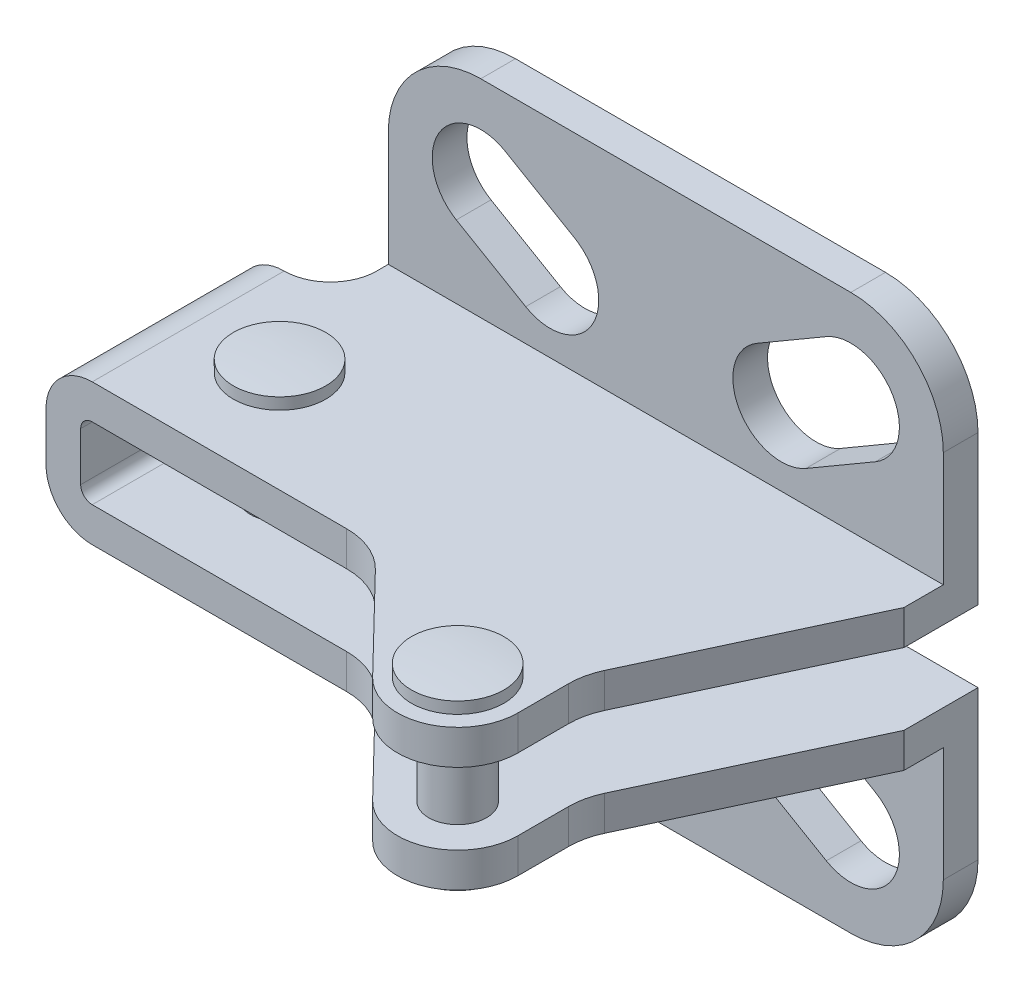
ISO-10303-21;
HEADER;
FILE_DESCRIPTION(('STEP AP214'),'2;1');
FILE_NAME('part.step','',(''),(''),'','','');
FILE_SCHEMA(('AUTOMOTIVE_DESIGN { 1 0 10303 214 1 1 1 1 }'));
ENDSEC;
DATA;
#1=APPLICATION_CONTEXT('core data for automotive mechanical design processes');
#2=APPLICATION_PROTOCOL_DEFINITION('international standard','automotive_design',2000,#1);
#3=PRODUCT_CONTEXT('',#1,'mechanical');
#4=PRODUCT('Part','Part','',(#3));
#5=PRODUCT_RELATED_PRODUCT_CATEGORY('part','',(#4));
#6=PRODUCT_DEFINITION_FORMATION('','',#4);
#7=PRODUCT_DEFINITION_CONTEXT('part definition',#1,'design');
#8=PRODUCT_DEFINITION('design','',#6,#7);
#9=PRODUCT_DEFINITION_SHAPE('','',#8);
#10=(LENGTH_UNIT() NAMED_UNIT(*) SI_UNIT(.MILLI.,.METRE.));
#11=(NAMED_UNIT(*) PLANE_ANGLE_UNIT() SI_UNIT($,.RADIAN.));
#12=(NAMED_UNIT(*) SI_UNIT($,.STERADIAN.) SOLID_ANGLE_UNIT());
#13=UNCERTAINTY_MEASURE_WITH_UNIT(LENGTH_MEASURE(1.E-05),#10,'distance_accuracy_value','');
#14=(GEOMETRIC_REPRESENTATION_CONTEXT(3) GLOBAL_UNCERTAINTY_ASSIGNED_CONTEXT((#13)) GLOBAL_UNIT_ASSIGNED_CONTEXT((#10,
#11,#12)) REPRESENTATION_CONTEXT('',''));
#15=CARTESIAN_POINT('',(0.,0.,0.));
#16=DIRECTION('',(0.,0.,1.));
#17=DIRECTION('',(1.,0.,0.));
#18=AXIS2_PLACEMENT_3D('',#15,#16,#17);
#19=CARTESIAN_POINT('',(13.,5.21142468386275,15.5));
#20=DIRECTION('',(0.,-1.,0.));
#21=DIRECTION('',(-1.,0.,0.));
#22=AXIS2_PLACEMENT_3D('',#19,#20,#21);
#23=CONICAL_SURFACE('',#22,0.75,1.04719755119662);
#24=CARTESIAN_POINT('',(13.,5.64443738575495,15.5));
#25=VERTEX_POINT('',#24);
#26=VERTEX_LOOP('',#25);
#27=FACE_BOUND('',#26,.T.);
#28=CARTESIAN_POINT('',(13.,5.21142468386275,15.5));
#29=DIRECTION('',(0.,1.,0.));
#30=DIRECTION('',(1.,0.,0.));
#31=AXIS2_PLACEMENT_3D('',#28,#29,#30);
#32=CIRCLE('',#31,0.75);
#33=CARTESIAN_POINT('',(13.75,5.21142468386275,15.5));
#34=VERTEX_POINT('',#33);
#35=EDGE_CURVE('E794',#34,#34,#32,.T.);
#36=ORIENTED_EDGE('',*,*,#35,.F.);
#37=EDGE_LOOP('',(#36));
#38=FACE_BOUND('',#37,.T.);
#39=ADVANCED_FACE('F14',(#27,#38),#23,.F.);
#40=CARTESIAN_POINT('',(13.,5.64443738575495,15.5));
#41=DIRECTION('',(0.,1.,0.));
#42=DIRECTION('',(1.,0.,0.));
#43=AXIS2_PLACEMENT_3D('',#40,#41,#42);
#44=CYLINDRICAL_SURFACE('',#43,0.75);
#45=ORIENTED_EDGE('',*,*,#35,.T.);
#46=EDGE_LOOP('',(#45));
#47=FACE_BOUND('',#46,.T.);
#48=CARTESIAN_POINT('',(13.,4.42549213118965,15.5));
#49=DIRECTION('',(0.,1.,0.));
#50=DIRECTION('',(1.,0.,0.));
#51=AXIS2_PLACEMENT_3D('',#48,#49,#50);
#52=CIRCLE('',#51,0.75);
#53=CARTESIAN_POINT('',(13.,4.42549213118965,14.7500000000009));
#54=VERTEX_POINT('',#53);
#55=EDGE_CURVE('E798',#54,#54,#52,.T.);
#56=ORIENTED_EDGE('',*,*,#55,.F.);
#57=EDGE_LOOP('',(#56));
#58=FACE_BOUND('',#57,.T.);
#59=ADVANCED_FACE('F2154',(#47,#58),#44,.F.);
#60=CARTESIAN_POINT('',(13.,24.4114246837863,15.4999999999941));
#61=DIRECTION('',(0.,1.,0.));
#62=DIRECTION('',(0.,0.,-1.));
#63=AXIS2_PLACEMENT_3D('',#60,#61,#62);
#64=SPHERICAL_SURFACE('',#63,19.9999999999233);
#65=CARTESIAN_POINT('',(13.,4.51167594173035,15.5));
#66=DIRECTION('',(0.,1.,0.));
#67=DIRECTION('',(1.,0.,0.));
#68=AXIS2_PLACEMENT_3D('',#65,#66,#67);
#69=CIRCLE('',#68,2.);
#70=CARTESIAN_POINT('',(13.,4.51167594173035,13.5000000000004));
#71=VERTEX_POINT('',#70);
#72=EDGE_CURVE('E2385',#71,#71,#69,.T.);
#73=CARTESIAN_POINT('',(13.,4.42549213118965,14.7500000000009));
#74=CARTESIAN_POINT('',(13.,4.42598165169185,14.7369553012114));
#75=CARTESIAN_POINT('',(13.,4.42648394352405,14.723911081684));
#76=CARTESIAN_POINT('',(13.,4.42751406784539,14.6978236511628));
#77=CARTESIAN_POINT('',(13.,4.42804190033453,14.684780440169));
#78=CARTESIAN_POINT('',(13.,4.42912310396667,14.6586950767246));
#79=CARTESIAN_POINT('',(13.,4.42967647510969,14.6456529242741));
#80=CARTESIAN_POINT('',(13.,4.43080875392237,14.6195697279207));
#81=CARTESIAN_POINT('',(13.,4.43138766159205,14.6065286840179));
#82=CARTESIAN_POINT('',(13.,4.43257101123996,14.5804477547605));
#83=CARTESIAN_POINT('',(13.,4.4331754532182,14.5674078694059));
#84=CARTESIAN_POINT('',(13.,4.43440986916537,14.5413293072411));
#85=CARTESIAN_POINT('',(13.,4.43503984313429,14.5282906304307));
#86=CARTESIAN_POINT('',(13.,4.43632532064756,14.5022145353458));
#87=CARTESIAN_POINT('',(13.,4.43698082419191,14.4891771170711));
#88=CARTESIAN_POINT('',(13.,4.43831735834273,14.463103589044));
#89=CARTESIAN_POINT('',(13.,4.43899838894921,14.4500674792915));
#90=CARTESIAN_POINT('',(13.,4.44038597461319,14.4239966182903));
#91=CARTESIAN_POINT('',(13.,4.44109252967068,14.4109618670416));
#92=CARTESIAN_POINT('',(13.,4.44253116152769,14.3848937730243));
#93=CARTESIAN_POINT('',(13.,4.4432632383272,14.3718604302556));
#94=CARTESIAN_POINT('',(13.,4.44475291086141,14.3457952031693));
#95=CARTESIAN_POINT('',(13.,4.4455105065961,14.3327633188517));
#96=CARTESIAN_POINT('',(13.,4.44705121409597,14.3067010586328));
#97=CARTESIAN_POINT('',(13.,4.44783432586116,14.2936706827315));
#98=CARTESIAN_POINT('',(13.,4.4494260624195,14.2676114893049));
#99=CARTESIAN_POINT('',(13.,4.45023468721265,14.2545826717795));
#100=CARTESIAN_POINT('',(13.,4.45187744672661,14.2285266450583));
#101=CARTESIAN_POINT('',(13.,4.4527115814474,14.2154994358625));
#102=CARTESIAN_POINT('',(13.,4.45440535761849,14.1894466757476));
#103=CARTESIAN_POINT('',(13.,4.45526499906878,14.1764211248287));
#104=CARTESIAN_POINT('',(13.,4.45700978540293,14.1503717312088));
#105=CARTESIAN_POINT('',(13.,4.45789493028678,14.1373478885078));
#106=CARTESIAN_POINT('',(13.,4.45969072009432,14.1113019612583));
#107=CARTESIAN_POINT('',(13.,4.460601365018,14.0982798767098));
#108=CARTESIAN_POINT('',(13.,4.46244815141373,14.0722375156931));
#109=CARTESIAN_POINT('',(13.,4.46338429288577,14.0592172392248));
#110=CARTESIAN_POINT('',(13.,4.46528206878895,14.0331785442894));
#111=CARTESIAN_POINT('',(13.,4.46624370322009,14.0201601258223));
#112=CARTESIAN_POINT('',(13.,4.46819246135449,13.9941251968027));
#113=CARTESIAN_POINT('',(13.,4.46917958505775,13.9811086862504));
#114=CARTESIAN_POINT('',(13.,4.47117931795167,13.9550776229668));
#115=CARTESIAN_POINT('',(13.,4.47219192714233,13.9420630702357));
#116=CARTESIAN_POINT('',(13.,4.47424262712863,13.9160359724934));
#117=CARTESIAN_POINT('',(13.,4.47528071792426,13.9030234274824));
#118=CARTESIAN_POINT('',(13.,4.47738237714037,13.8770003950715));
#119=CARTESIAN_POINT('',(13.,4.47844594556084,13.8639899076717));
#120=CARTESIAN_POINT('',(13.,4.48059855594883,13.8379710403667));
#121=CARTESIAN_POINT('',(13.,4.48168759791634,13.8249626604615));
#122=CARTESIAN_POINT('',(13.,4.48389115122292,13.7989480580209));
#123=CARTESIAN_POINT('',(13.,4.48500566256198,13.7859418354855));
#124=CARTESIAN_POINT('',(13.,4.48726015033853,13.7599315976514));
#125=CARTESIAN_POINT('',(13.,4.48840012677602,13.7469275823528));
#126=CARTESIAN_POINT('',(13.,4.49070554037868,13.7209218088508));
#127=CARTESIAN_POINT('',(13.,4.49187097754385,13.7079200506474));
#128=CARTESIAN_POINT('',(13.,4.49422730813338,13.6819188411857));
#129=CARTESIAN_POINT('',(13.,4.49541820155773,13.6689193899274));
#130=CARTESIAN_POINT('',(13.,4.49782544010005,13.6429228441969));
#131=CARTESIAN_POINT('',(13.,4.49904178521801,13.6299257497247));
#132=CARTESIAN_POINT('',(13.,4.50149992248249,13.6039339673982));
#133=CARTESIAN_POINT('',(13.,4.502741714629,13.5909392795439));
#134=CARTESIAN_POINT('',(13.,4.50525074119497,13.5649523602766));
#135=CARTESIAN_POINT('',(13.,4.50651797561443,13.5519601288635));
#136=CARTESIAN_POINT('',(13.,4.50907788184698,13.5259781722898));
#137=CARTESIAN_POINT('',(13.,4.51037055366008,13.5129884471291));
#138=CARTESIAN_POINT('',(13.,4.51167594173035,13.5000000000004));
#139=B_SPLINE_CURVE_WITH_KNOTS('',3,(#73,#74,#75,#76,#77,#78,#79,#80,#81,#82,#83,#84,#85,#86,
#87,#88,#89,#90,#91,#92,#93,#94,#95,#96,#97,#98,#99,#100,#101,#102,#103,#104,#105,#106,#107,
#108,#109,#110,#111,#112,#113,#114,#115,#116,#117,#118,#119,#120,#121,#122,#123,#124,#125,#126,
#127,#128,#129,#130,#131,#132,#133,#134,#135,#136,#137,#138),.UNSPECIFIED.,.F.,.F.,(4,2,2,2,2,2,
2,2,2,2,2,2,2,2,2,2,2,2,2,2,2,2,2,2,2,2,2,2,2,2,2,2,4),(0.,0.0391616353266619,
0.0783232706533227,0.117484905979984,0.156646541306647,0.195808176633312,0.234969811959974,
0.274131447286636,0.313293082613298,0.352454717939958,0.39161635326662,0.430777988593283,
0.469939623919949,0.509101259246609,0.548262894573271,0.587424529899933,0.626586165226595,
0.665747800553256,0.704909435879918,0.744071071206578,0.783232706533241,0.822394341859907,
0.861555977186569,0.90071761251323,0.939879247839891,0.979040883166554,1.01820251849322,
1.05736415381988,1.09652578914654,1.1356874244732,1.17484905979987,1.21401069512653,
1.25317233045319),.UNSPECIFIED.);
#140=EDGE_CURVE('BSEAM2165',#54,#71,#139,.T.);
#141=ORIENTED_EDGE('',*,*,#55,.T.);
#142=ORIENTED_EDGE('',*,*,#72,.F.);
#143=ORIENTED_EDGE('',*,*,#140,.T.);
#144=ORIENTED_EDGE('',*,*,#140,.F.);
#145=EDGE_LOOP('',(#141,#143,#142,#144));
#146=FACE_BOUND('',#145,.T.);
#147=ADVANCED_FACE('F2165',(#146),#64,.T.);
#148=CARTESIAN_POINT('',(13.,5.64443738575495,15.5));
#149=DIRECTION('',(0.,1.,0.));
#150=DIRECTION('',(1.,0.,0.));
#151=AXIS2_PLACEMENT_3D('',#148,#149,#150);
#152=CYLINDRICAL_SURFACE('',#151,2.);
#153=CARTESIAN_POINT('',(13.,4.95,15.5));
#154=DIRECTION('',(0.,-1.,0.));
#155=DIRECTION('',(0.,0.,1.));
#156=AXIS2_PLACEMENT_3D('',#153,#154,#155);
#157=CIRCLE('',#156,2.);
#158=CARTESIAN_POINT('',(13.,4.95,17.5));
#159=VERTEX_POINT('',#158);
#160=EDGE_CURVE('E2324',#159,#159,#157,.F.);
#161=ORIENTED_EDGE('',*,*,#160,.F.);
#162=EDGE_LOOP('',(#161));
#163=FACE_BOUND('',#162,.T.);
#164=ORIENTED_EDGE('',*,*,#72,.T.);
#165=EDGE_LOOP('',(#164));
#166=FACE_BOUND('',#165,.T.);
#167=ADVANCED_FACE('F2177',(#163,#166),#152,.T.);
#168=CARTESIAN_POINT('',(13.,5.64443738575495,15.5));
#169=DIRECTION('',(0.,1.,0.));
#170=DIRECTION('',(1.,0.,0.));
#171=AXIS2_PLACEMENT_3D('',#168,#169,#170);
#172=CYLINDRICAL_SURFACE('',#171,1.25);
#173=CARTESIAN_POINT('',(13.,9.55,15.5));
#174=DIRECTION('',(0.,-1.,0.));
#175=DIRECTION('',(0.,0.,1.));
#176=AXIS2_PLACEMENT_3D('',#173,#174,#175);
#177=CIRCLE('',#176,1.25);
#178=CARTESIAN_POINT('',(13.,9.55,16.75));
#179=VERTEX_POINT('',#178);
#180=EDGE_CURVE('E24',#179,#179,#177,.F.);
#181=ORIENTED_EDGE('',*,*,#180,.F.);
#182=EDGE_LOOP('',(#181));
#183=FACE_BOUND('',#182,.T.);
#184=CARTESIAN_POINT('',(13.,6.45,15.5));
#185=DIRECTION('',(0.,1.,0.));
#186=DIRECTION('',(0.,0.,-1.));
#187=AXIS2_PLACEMENT_3D('',#184,#185,#186);
#188=CIRCLE('',#187,1.25);
#189=CARTESIAN_POINT('',(13.,6.45,14.25));
#190=VERTEX_POINT('',#189);
#191=EDGE_CURVE('E2328',#190,#190,#188,.F.);
#192=ORIENTED_EDGE('',*,*,#191,.F.);
#193=EDGE_LOOP('',(#192));
#194=FACE_BOUND('',#193,.T.);
#195=ADVANCED_FACE('F2141',(#183,#194),#172,.T.);
#196=CARTESIAN_POINT('',(13.,11.1114246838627,15.5));
#197=DIRECTION('',(0.,1.,0.));
#198=DIRECTION('',(1.,0.,0.));
#199=AXIS2_PLACEMENT_3D('',#196,#197,#198);
#200=CIRCLE('',#199,1.25);
#201=CARTESIAN_POINT('',(14.25,11.1114246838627,15.5));
#202=VERTEX_POINT('',#201);
#203=EDGE_CURVE('E2331',#202,#202,#200,.T.);
#204=ORIENTED_EDGE('',*,*,#203,.F.);
#205=EDGE_LOOP('',(#204));
#206=FACE_BOUND('',#205,.T.);
#207=CARTESIAN_POINT('',(13.,11.05,15.5));
#208=DIRECTION('',(0.,-1.,0.));
#209=DIRECTION('',(0.,0.,1.));
#210=AXIS2_PLACEMENT_3D('',#207,#208,#209);
#211=CIRCLE('',#210,1.25);
#212=CARTESIAN_POINT('',(13.,11.05,16.75));
#213=VERTEX_POINT('',#212);
#214=EDGE_CURVE('E9',#213,#213,#211,.F.);
#215=ORIENTED_EDGE('',*,*,#214,.T.);
#216=EDGE_LOOP('',(#215));
#217=FACE_BOUND('',#216,.T.);
#218=ADVANCED_FACE('F2136',(#206,#217),#172,.T.);
#219=CARTESIAN_POINT('',(13.,-8.28857531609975,15.4999999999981));
#220=DIRECTION('',(0.,1.,0.));
#221=DIRECTION('',(0.,0.,1.));
#222=AXIS2_PLACEMENT_3D('',#219,#220,#221);
#223=SPHERICAL_SURFACE('',#222,19.9999999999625);
#224=CARTESIAN_POINT('',(13.,11.6111734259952,15.5));
#225=DIRECTION('',(0.,1.,0.));
#226=DIRECTION('',(1.,0.,0.));
#227=AXIS2_PLACEMENT_3D('',#224,#225,#226);
#228=CIRCLE('',#227,2.);
#229=CARTESIAN_POINT('',(15.,11.6111734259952,15.5));
#230=VERTEX_POINT('',#229);
#231=EDGE_CURVE('E2322',#230,#230,#228,.T.);
#232=ORIENTED_EDGE('',*,*,#231,.T.);
#233=EDGE_LOOP('',(#232));
#234=FACE_BOUND('',#233,.T.);
#235=ADVANCED_FACE('F2140',(#234),#223,.T.);
#236=CARTESIAN_POINT('',(13.,5.64443738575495,15.5));
#237=DIRECTION('',(0.,1.,0.));
#238=DIRECTION('',(1.,0.,0.));
#239=AXIS2_PLACEMENT_3D('',#236,#237,#238);
#240=CYLINDRICAL_SURFACE('',#239,2.);
#241=CARTESIAN_POINT('',(13.,11.1114246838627,15.5));
#242=DIRECTION('',(0.,1.,0.));
#243=DIRECTION('',(1.,0.,0.));
#244=AXIS2_PLACEMENT_3D('',#241,#242,#243);
#245=CIRCLE('',#244,2.);
#246=CARTESIAN_POINT('',(15.,11.1114246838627,15.5));
#247=VERTEX_POINT('',#246);
#248=EDGE_CURVE('E2325',#247,#247,#245,.T.);
#249=ORIENTED_EDGE('',*,*,#248,.T.);
#250=EDGE_LOOP('',(#249));
#251=FACE_BOUND('',#250,.T.);
#252=ORIENTED_EDGE('',*,*,#231,.F.);
#253=EDGE_LOOP('',(#252));
#254=FACE_BOUND('',#253,.T.);
#255=ADVANCED_FACE('F843',(#251,#254),#240,.T.);
#256=CARTESIAN_POINT('',(13.,11.1114246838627,13.5));
#257=DIRECTION('',(0.,-1.,0.));
#258=DIRECTION('',(-1.,0.,0.));
#259=AXIS2_PLACEMENT_3D('',#256,#257,#258);
#260=PLANE('',#259);
#261=ORIENTED_EDGE('',*,*,#203,.T.);
#262=EDGE_LOOP('',(#261));
#263=FACE_BOUND('',#262,.T.);
#264=ORIENTED_EDGE('',*,*,#248,.F.);
#265=EDGE_LOOP('',(#264));
#266=FACE_BOUND('',#265,.T.);
#267=ADVANCED_FACE('F832',(#263,#266),#260,.T.);
#268=CARTESIAN_POINT('',(-2.1999999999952,-8.2497487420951,8.00000000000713));
#269=DIRECTION('',(0.,1.,0.));
#270=DIRECTION('',(-0.074220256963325,0.,0.99724187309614));
#271=AXIS2_PLACEMENT_3D('',#268,#269,#270);
#272=SPHERICAL_SURFACE('',#271,19.9999999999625);
#273=CARTESIAN_POINT('',(-2.1999999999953,11.6499999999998,8.00000000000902));
#274=DIRECTION('',(0.,1.,0.));
#275=DIRECTION('',(0.99724187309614,0.,0.074220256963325));
#276=AXIS2_PLACEMENT_3D('',#273,#274,#275);
#277=CIRCLE('',#276,2.);
#278=CARTESIAN_POINT('',(-0.20551625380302,11.6499999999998,8.14844051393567));
#279=VERTEX_POINT('',#278);
#280=EDGE_CURVE('E2353',#279,#279,#277,.T.);
#281=ORIENTED_EDGE('',*,*,#280,.T.);
#282=EDGE_LOOP('',(#281));
#283=FACE_BOUND('',#282,.T.);
#284=ADVANCED_FACE('F829',(#283),#272,.T.);
#285=CARTESIAN_POINT('',(-2.1999999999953,5.25025125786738,8.00000000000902));
#286=DIRECTION('',(0.,-1.,0.));
#287=DIRECTION('',(-0.99724187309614,0.,-0.074220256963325));
#288=AXIS2_PLACEMENT_3D('',#285,#286,#287);
#289=CONICAL_SURFACE('',#288,0.75,1.04719755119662);
#290=CARTESIAN_POINT('',(-2.1999999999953,5.68326395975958,8.00000000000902));
#291=VERTEX_POINT('',#290);
#292=VERTEX_LOOP('',#291);
#293=FACE_BOUND('',#292,.T.);
#294=CARTESIAN_POINT('',(-2.1999999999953,5.25025125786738,8.00000000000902));
#295=DIRECTION('',(0.,1.,0.));
#296=DIRECTION('',(0.99724187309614,0.,0.074220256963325));
#297=AXIS2_PLACEMENT_3D('',#294,#295,#296);
#298=CIRCLE('',#297,0.75);
#299=CARTESIAN_POINT('',(-1.4520685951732,5.25025125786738,8.05566519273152));
#300=VERTEX_POINT('',#299);
#301=EDGE_CURVE('E791',#300,#300,#298,.T.);
#302=ORIENTED_EDGE('',*,*,#301,.F.);
#303=EDGE_LOOP('',(#302));
#304=FACE_BOUND('',#303,.T.);
#305=ADVANCED_FACE('F831',(#293,#304),#289,.F.);
#306=CARTESIAN_POINT('',(-2.1999999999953,5.68326395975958,8.00000000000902));
#307=DIRECTION('',(0.,1.,0.));
#308=DIRECTION('',(0.99724187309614,0.,0.074220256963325));
#309=AXIS2_PLACEMENT_3D('',#306,#307,#308);
#310=CYLINDRICAL_SURFACE('',#309,2.);
#311=CARTESIAN_POINT('',(-2.1999999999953,11.1502512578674,8.00000000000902));
#312=DIRECTION('',(0.,1.,0.));
#313=DIRECTION('',(0.99724187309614,0.,0.074220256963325));
#314=AXIS2_PLACEMENT_3D('',#311,#312,#313);
#315=CIRCLE('',#314,2.);
#316=CARTESIAN_POINT('',(-0.20551625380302,11.1502512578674,8.14844051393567));
#317=VERTEX_POINT('',#316);
#318=EDGE_CURVE('E2350',#317,#317,#315,.T.);
#319=ORIENTED_EDGE('',*,*,#318,.T.);
#320=EDGE_LOOP('',(#319));
#321=FACE_BOUND('',#320,.T.);
#322=ORIENTED_EDGE('',*,*,#280,.F.);
#323=EDGE_LOOP('',(#322));
#324=FACE_BOUND('',#323,.T.);
#325=ADVANCED_FACE('F840',(#321,#324),#310,.T.);
#326=CARTESIAN_POINT('',(-2.1999999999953,5.68326395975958,8.00000000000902));
#327=DIRECTION('',(0.,1.,0.));
#328=DIRECTION('',(0.99724187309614,0.,0.074220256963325));
#329=AXIS2_PLACEMENT_3D('',#326,#327,#328);
#330=CYLINDRICAL_SURFACE('',#329,0.75);
#331=ORIENTED_EDGE('',*,*,#301,.T.);
#332=EDGE_LOOP('',(#331));
#333=FACE_BOUND('',#332,.T.);
#334=CARTESIAN_POINT('',(-2.1999999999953,4.46431870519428,8.00000000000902));
#335=DIRECTION('',(0.,1.,0.));
#336=DIRECTION('',(0.99724187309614,0.,0.074220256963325));
#337=AXIS2_PLACEMENT_3D('',#334,#335,#336);
#338=CIRCLE('',#337,0.75);
#339=CARTESIAN_POINT('',(-2.1443348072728,4.46431870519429,7.25206859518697));
#340=VERTEX_POINT('',#339);
#341=EDGE_CURVE('E2341',#340,#340,#338,.T.);
#342=ORIENTED_EDGE('',*,*,#341,.F.);
#343=EDGE_LOOP('',(#342));
#344=FACE_BOUND('',#343,.T.);
#345=ADVANCED_FACE('F2083',(#333,#344),#330,.F.);
#346=CARTESIAN_POINT('',(-2.05155948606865,11.1502512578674,6.00551625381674));
#347=DIRECTION('',(0.,-1.,0.));
#348=DIRECTION('',(-0.99724187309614,0.,-0.074220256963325));
#349=AXIS2_PLACEMENT_3D('',#346,#347,#348);
#350=PLANE('',#349);
#351=CARTESIAN_POINT('',(-2.1999999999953,11.1502512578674,8.00000000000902));
#352=DIRECTION('',(0.,1.,0.));
#353=DIRECTION('',(0.99724187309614,0.,0.074220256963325));
#354=AXIS2_PLACEMENT_3D('',#351,#352,#353);
#355=CIRCLE('',#354,1.25);
#356=CARTESIAN_POINT('',(-0.953447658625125,11.1502512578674,8.09277532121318));
#357=VERTEX_POINT('',#356);
#358=EDGE_CURVE('E2347',#357,#357,#355,.T.);
#359=ORIENTED_EDGE('',*,*,#358,.T.);
#360=EDGE_LOOP('',(#359));
#361=FACE_BOUND('',#360,.T.);
#362=ORIENTED_EDGE('',*,*,#318,.F.);
#363=EDGE_LOOP('',(#362));
#364=FACE_BOUND('',#363,.T.);
#365=ADVANCED_FACE('F856',(#361,#364),#350,.T.);
#366=CARTESIAN_POINT('',(4.058129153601,16.0639356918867,1.5));
#367=DIRECTION('',(-0.503871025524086,-0.863778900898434,0.));
#368=DIRECTION('',(0.863778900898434,-0.503871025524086,0.));
#369=AXIS2_PLACEMENT_3D('',#366,#367,#368);
#370=PLANE('',#369);
#371=DIRECTION('',(-0.863778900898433,0.503871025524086,0.));
#372=VECTOR('',#371,1.);
#373=CARTESIAN_POINT('',(4.058129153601,16.0639356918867,0.));
#374=LINE('',#373,#372);
#375=CARTESIAN_POINT('',(4.058129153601,16.0639356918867,0.));
#376=VERTEX_POINT('',#375);
#377=CARTESIAN_POINT('',(1.058129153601,17.8139356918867,0.));
#378=VERTEX_POINT('',#377);
#379=EDGE_CURVE('E370',#376,#378,#374,.T.);
#380=ORIENTED_EDGE('',*,*,#379,.F.);
#381=DIRECTION('',(0.,0.,-1.));
#382=VECTOR('',#381,1.);
#383=CARTESIAN_POINT('',(4.058129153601,16.0639356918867,1.5));
#384=LINE('',#383,#382);
#385=CARTESIAN_POINT('',(4.058129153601,16.0639356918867,1.5));
#386=VERTEX_POINT('',#385);
#387=EDGE_CURVE('E388',#386,#376,#384,.T.);
#388=ORIENTED_EDGE('',*,*,#387,.F.);
#389=DIRECTION('',(-0.863778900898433,0.503871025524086,0.));
#390=VECTOR('',#389,1.);
#391=CARTESIAN_POINT('',(4.058129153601,16.0639356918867,1.5));
#392=LINE('',#391,#390);
#393=CARTESIAN_POINT('',(1.058129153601,17.8139356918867,1.5));
#394=VERTEX_POINT('',#393);
#395=EDGE_CURVE('E384',#386,#394,#392,.T.);
#396=ORIENTED_EDGE('',*,*,#395,.T.);
#397=DIRECTION('',(0.,0.,-1.));
#398=VECTOR('',#397,1.);
#399=CARTESIAN_POINT('',(1.058129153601,17.8139356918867,1.5));
#400=LINE('',#399,#398);
#401=EDGE_CURVE('E342',#394,#378,#400,.T.);
#402=ORIENTED_EDGE('',*,*,#401,.T.);
#403=EDGE_LOOP('',(#380,#388,#396,#402));
#404=FACE_BOUND('',#403,.T.);
#405=ADVANCED_FACE('F852',(#404),#370,.T.);
#406=CARTESIAN_POINT('',(3.,14.25,1.5));
#407=DIRECTION('',(0.,0.,-1.));
#408=DIRECTION('',(0.,-1.,0.));
#409=AXIS2_PLACEMENT_3D('',#406,#407,#408);
#410=CYLINDRICAL_SURFACE('',#409,2.1000000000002);
#411=CARTESIAN_POINT('',(3.,14.25,0.));
#412=DIRECTION('',(0.,0.,1.));
#413=DIRECTION('',(-1.,0.,0.));
#414=AXIS2_PLACEMENT_3D('',#411,#412,#413);
#415=CIRCLE('',#414,2.1000000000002);
#416=CARTESIAN_POINT('',(1.941870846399,12.4360643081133,0.));
#417=VERTEX_POINT('',#416);
#418=EDGE_CURVE('E360',#417,#376,#415,.T.);
#419=ORIENTED_EDGE('',*,*,#418,.F.);
#420=DIRECTION('',(0.,0.,-1.));
#421=VECTOR('',#420,1.);
#422=CARTESIAN_POINT('',(1.941870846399,12.4360643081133,1.5));
#423=LINE('',#422,#421);
#424=CARTESIAN_POINT('',(1.941870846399,12.4360643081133,1.5));
#425=VERTEX_POINT('',#424);
#426=EDGE_CURVE('E355',#425,#417,#423,.T.);
#427=ORIENTED_EDGE('',*,*,#426,.F.);
#428=CARTESIAN_POINT('',(3.,14.25,1.5));
#429=DIRECTION('',(0.,0.,1.));
#430=DIRECTION('',(-1.,0.,0.));
#431=AXIS2_PLACEMENT_3D('',#428,#429,#430);
#432=CIRCLE('',#431,2.1000000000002);
#433=EDGE_CURVE('E378',#425,#386,#432,.T.);
#434=ORIENTED_EDGE('',*,*,#433,.T.);
#435=ORIENTED_EDGE('',*,*,#387,.T.);
#436=EDGE_LOOP('',(#419,#427,#434,#435));
#437=FACE_BOUND('',#436,.T.);
#438=ADVANCED_FACE('F855',(#437),#410,.F.);
#439=CARTESIAN_POINT('',(-1.058129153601,14.1860643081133,1.5));
#440=DIRECTION('',(0.503871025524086,0.863778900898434,0.));
#441=DIRECTION('',(-0.863778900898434,0.503871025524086,0.));
#442=AXIS2_PLACEMENT_3D('',#439,#440,#441);
#443=PLANE('',#442);
#444=DIRECTION('',(0.863778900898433,-0.503871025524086,0.));
#445=VECTOR('',#444,1.);
#446=CARTESIAN_POINT('',(-1.058129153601,14.1860643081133,0.));
#447=LINE('',#446,#445);
#448=CARTESIAN_POINT('',(-1.058129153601,14.1860643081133,0.));
#449=VERTEX_POINT('',#448);
#450=EDGE_CURVE('E349',#449,#417,#447,.T.);
#451=ORIENTED_EDGE('',*,*,#450,.F.);
#452=DIRECTION('',(0.,0.,-1.));
#453=VECTOR('',#452,1.);
#454=CARTESIAN_POINT('',(-1.058129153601,14.1860643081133,1.5));
#455=LINE('',#454,#453);
#456=CARTESIAN_POINT('',(-1.058129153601,14.1860643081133,1.5));
#457=VERTEX_POINT('',#456);
#458=EDGE_CURVE('E352',#457,#449,#455,.T.);
#459=ORIENTED_EDGE('',*,*,#458,.F.);
#460=DIRECTION('',(0.863778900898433,-0.503871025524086,0.));
#461=VECTOR('',#460,1.);
#462=CARTESIAN_POINT('',(-1.058129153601,14.1860643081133,1.5));
#463=LINE('',#462,#461);
#464=EDGE_CURVE('E372',#457,#425,#463,.T.);
#465=ORIENTED_EDGE('',*,*,#464,.T.);
#466=ORIENTED_EDGE('',*,*,#426,.T.);
#467=EDGE_LOOP('',(#451,#459,#465,#466));
#468=FACE_BOUND('',#467,.T.);
#469=ADVANCED_FACE('F351',(#468),#443,.T.);
#470=CARTESIAN_POINT('',(0.,16.,1.5));
#471=DIRECTION('',(0.,0.,-1.));
#472=DIRECTION('',(0.,-1.,0.));
#473=AXIS2_PLACEMENT_3D('',#470,#471,#472);
#474=CYLINDRICAL_SURFACE('',#473,2.1000000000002);
#475=CARTESIAN_POINT('',(0.,16.,0.));
#476=DIRECTION('',(0.,0.,1.));
#477=DIRECTION('',(1.,0.,0.));
#478=AXIS2_PLACEMENT_3D('',#475,#476,#477);
#479=CIRCLE('',#478,2.1000000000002);
#480=EDGE_CURVE('E363',#378,#449,#479,.T.);
#481=ORIENTED_EDGE('',*,*,#480,.F.);
#482=ORIENTED_EDGE('',*,*,#401,.F.);
#483=CARTESIAN_POINT('',(0.,16.,1.5));
#484=DIRECTION('',(0.,0.,1.));
#485=DIRECTION('',(1.,0.,0.));
#486=AXIS2_PLACEMENT_3D('',#483,#484,#485);
#487=CIRCLE('',#486,2.1000000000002);
#488=EDGE_CURVE('E366',#394,#457,#487,.T.);
#489=ORIENTED_EDGE('',*,*,#488,.T.);
#490=ORIENTED_EDGE('',*,*,#458,.T.);
#491=EDGE_LOOP('',(#481,#482,#489,#490));
#492=FACE_BOUND('',#491,.T.);
#493=ADVANCED_FACE('F362',(#492),#474,.F.);
#494=CARTESIAN_POINT('',(15.9999999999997,15.9999999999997,1.5));
#495=DIRECTION('',(0.,0.,-1.));
#496=DIRECTION('',(0.,-1.,0.));
#497=AXIS2_PLACEMENT_3D('',#494,#495,#496);
#498=CYLINDRICAL_SURFACE('',#497,4.00000000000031);
#499=CARTESIAN_POINT('',(15.9999999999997,15.9999999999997,0.));
#500=DIRECTION('',(0.,0.,1.));
#501=DIRECTION('',(-1.,0.,0.));
#502=AXIS2_PLACEMENT_3D('',#499,#500,#501);
#503=CIRCLE('',#502,4.00000000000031);
#504=CARTESIAN_POINT('',(20.,16.,0.));
#505=VERTEX_POINT('',#504);
#506=CARTESIAN_POINT('',(16.,20.,0.));
#507=VERTEX_POINT('',#506);
#508=EDGE_CURVE('E604',#505,#507,#503,.T.);
#509=ORIENTED_EDGE('',*,*,#508,.T.);
#510=DIRECTION('',(0.,0.,-1.));
#511=VECTOR('',#510,1.);
#512=CARTESIAN_POINT('',(16.,20.,1.5));
#513=LINE('',#512,#511);
#514=CARTESIAN_POINT('',(16.,20.,1.5));
#515=VERTEX_POINT('',#514);
#516=EDGE_CURVE('E661',#515,#507,#513,.T.);
#517=ORIENTED_EDGE('',*,*,#516,.F.);
#518=CARTESIAN_POINT('',(15.9999999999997,15.9999999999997,1.5));
#519=DIRECTION('',(0.,0.,1.));
#520=DIRECTION('',(-1.,0.,0.));
#521=AXIS2_PLACEMENT_3D('',#518,#519,#520);
#522=CIRCLE('',#521,4.00000000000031);
#523=CARTESIAN_POINT('',(20.,16.,1.5));
#524=VERTEX_POINT('',#523);
#525=EDGE_CURVE('E625',#524,#515,#522,.T.);
#526=ORIENTED_EDGE('',*,*,#525,.F.);
#527=DIRECTION('',(0.,0.,-1.));
#528=VECTOR('',#527,1.);
#529=CARTESIAN_POINT('',(20.,16.,1.5));
#530=LINE('',#529,#528);
#531=EDGE_CURVE('E664',#524,#505,#530,.T.);
#532=ORIENTED_EDGE('',*,*,#531,.T.);
#533=EDGE_LOOP('',(#509,#517,#526,#532));
#534=FACE_BOUND('',#533,.T.);
#535=ADVANCED_FACE('F851',(#534),#498,.T.);
#536=CARTESIAN_POINT('',(16.,20.,1.5));
#537=DIRECTION('',(0.,-1.,0.));
#538=DIRECTION('',(1.,0.,0.));
#539=AXIS2_PLACEMENT_3D('',#536,#537,#538);
#540=PLANE('',#539);
#541=DIRECTION('',(-1.,0.,0.));
#542=VECTOR('',#541,1.);
#543=CARTESIAN_POINT('',(16.,20.,0.));
#544=LINE('',#543,#542);
#545=CARTESIAN_POINT('',(0.,20.,0.));
#546=VERTEX_POINT('',#545);
#547=EDGE_CURVE('E607',#507,#546,#544,.T.);
#548=ORIENTED_EDGE('',*,*,#547,.T.);
#549=DIRECTION('',(0.,0.,-1.));
#550=VECTOR('',#549,1.);
#551=CARTESIAN_POINT('',(0.,20.,1.5));
#552=LINE('',#551,#550);
#553=CARTESIAN_POINT('',(0.,20.,1.5));
#554=VERTEX_POINT('',#553);
#555=EDGE_CURVE('E658',#554,#546,#552,.T.);
#556=ORIENTED_EDGE('',*,*,#555,.F.);
#557=DIRECTION('',(-1.,0.,0.));
#558=VECTOR('',#557,1.);
#559=CARTESIAN_POINT('',(16.,20.,1.5));
#560=LINE('',#559,#558);
#561=EDGE_CURVE('E627',#515,#554,#560,.T.);
#562=ORIENTED_EDGE('',*,*,#561,.F.);
#563=ORIENTED_EDGE('',*,*,#516,.T.);
#564=EDGE_LOOP('',(#548,#556,#562,#563));
#565=FACE_BOUND('',#564,.T.);
#566=ADVANCED_FACE('F960',(#565),#540,.F.);
#567=CARTESIAN_POINT('',(6.52256026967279E-13,15.9999999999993,1.5));
#568=DIRECTION('',(0.,0.,-1.));
#569=DIRECTION('',(0.,-1.,0.));
#570=AXIS2_PLACEMENT_3D('',#567,#568,#569);
#571=CYLINDRICAL_SURFACE('',#570,4.00000000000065);
#572=CARTESIAN_POINT('',(6.52256026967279E-13,15.9999999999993,0.));
#573=DIRECTION('',(0.,0.,1.));
#574=DIRECTION('',(1.,0.,0.));
#575=AXIS2_PLACEMENT_3D('',#572,#573,#574);
#576=CIRCLE('',#575,4.00000000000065);
#577=CARTESIAN_POINT('',(-4.,15.9999999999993,0.));
#578=VERTEX_POINT('',#577);
#579=EDGE_CURVE('E610',#546,#578,#576,.T.);
#580=ORIENTED_EDGE('',*,*,#579,.T.);
#581=DIRECTION('',(0.,0.,-1.));
#582=VECTOR('',#581,1.);
#583=CARTESIAN_POINT('',(-4.,15.9999999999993,1.5));
#584=LINE('',#583,#582);
#585=CARTESIAN_POINT('',(-4.,15.9999999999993,1.5));
#586=VERTEX_POINT('',#585);
#587=EDGE_CURVE('E655',#586,#578,#584,.T.);
#588=ORIENTED_EDGE('',*,*,#587,.F.);
#589=CARTESIAN_POINT('',(6.52256026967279E-13,15.9999999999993,1.5));
#590=DIRECTION('',(0.,0.,1.));
#591=DIRECTION('',(1.,0.,0.));
#592=AXIS2_PLACEMENT_3D('',#589,#590,#591);
#593=CIRCLE('',#592,4.00000000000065);
#594=EDGE_CURVE('E630',#554,#586,#593,.T.);
#595=ORIENTED_EDGE('',*,*,#594,.F.);
#596=ORIENTED_EDGE('',*,*,#555,.T.);
#597=EDGE_LOOP('',(#580,#588,#595,#596));
#598=FACE_BOUND('',#597,.T.);
#599=ADVANCED_FACE('F873',(#598),#571,.T.);
#600=CARTESIAN_POINT('',(14.9418708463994,17.8139356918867,1.5));
#601=DIRECTION('',(0.503871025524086,-0.863778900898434,0.));
#602=DIRECTION('',(0.863778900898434,0.503871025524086,0.));
#603=AXIS2_PLACEMENT_3D('',#600,#601,#602);
#604=PLANE('',#603);
#605=DIRECTION('',(-0.863778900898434,-0.503871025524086,0.));
#606=VECTOR('',#605,1.);
#607=CARTESIAN_POINT('',(14.9418708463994,17.8139356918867,0.));
#608=LINE('',#607,#606);
#609=CARTESIAN_POINT('',(14.9418708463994,17.8139356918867,0.));
#610=VERTEX_POINT('',#609);
#611=CARTESIAN_POINT('',(11.9418708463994,16.0639356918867,0.));
#612=VERTEX_POINT('',#611);
#613=EDGE_CURVE('E396',#610,#612,#608,.T.);
#614=ORIENTED_EDGE('',*,*,#613,.F.);
#615=DIRECTION('',(0.,0.,-1.));
#616=VECTOR('',#615,1.);
#617=CARTESIAN_POINT('',(14.9418708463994,17.8139356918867,1.5));
#618=LINE('',#617,#616);
#619=CARTESIAN_POINT('',(14.9418708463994,17.8139356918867,1.5));
#620=VERTEX_POINT('',#619);
#621=EDGE_CURVE('E420',#620,#610,#618,.T.);
#622=ORIENTED_EDGE('',*,*,#621,.F.);
#623=DIRECTION('',(-0.863778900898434,-0.503871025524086,0.));
#624=VECTOR('',#623,1.);
#625=CARTESIAN_POINT('',(14.9418708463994,17.8139356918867,1.5));
#626=LINE('',#625,#624);
#627=CARTESIAN_POINT('',(11.9418708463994,16.0639356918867,1.5));
#628=VERTEX_POINT('',#627);
#629=EDGE_CURVE('E409',#620,#628,#626,.T.);
#630=ORIENTED_EDGE('',*,*,#629,.T.);
#631=DIRECTION('',(0.,0.,-1.));
#632=VECTOR('',#631,1.);
#633=CARTESIAN_POINT('',(11.9418708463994,16.0639356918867,1.5));
#634=LINE('',#633,#632);
#635=EDGE_CURVE('E418',#628,#612,#634,.T.);
#636=ORIENTED_EDGE('',*,*,#635,.T.);
#637=EDGE_LOOP('',(#614,#622,#630,#636));
#638=FACE_BOUND('',#637,.T.);
#639=ADVANCED_FACE('F869',(#638),#604,.T.);
#640=CARTESIAN_POINT('',(16.,16.,1.5));
#641=DIRECTION('',(0.,0.,-1.));
#642=DIRECTION('',(0.,-1.,0.));
#643=AXIS2_PLACEMENT_3D('',#640,#641,#642);
#644=CYLINDRICAL_SURFACE('',#643,2.1);
#645=CARTESIAN_POINT('',(16.,16.,0.));
#646=DIRECTION('',(0.,0.,1.));
#647=DIRECTION('',(-1.,0.,0.));
#648=AXIS2_PLACEMENT_3D('',#645,#646,#647);
#649=CIRCLE('',#648,2.1);
#650=CARTESIAN_POINT('',(17.0581291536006,14.1860643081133,0.));
#651=VERTEX_POINT('',#650);
#652=EDGE_CURVE('E392',#651,#610,#649,.T.);
#653=ORIENTED_EDGE('',*,*,#652,.F.);
#654=DIRECTION('',(0.,0.,-1.));
#655=VECTOR('',#654,1.);
#656=CARTESIAN_POINT('',(17.0581291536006,14.1860643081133,1.5));
#657=LINE('',#656,#655);
#658=CARTESIAN_POINT('',(17.0581291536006,14.1860643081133,1.5));
#659=VERTEX_POINT('',#658);
#660=EDGE_CURVE('E422',#659,#651,#657,.T.);
#661=ORIENTED_EDGE('',*,*,#660,.F.);
#662=CARTESIAN_POINT('',(16.,16.,1.5));
#663=DIRECTION('',(0.,0.,1.));
#664=DIRECTION('',(-1.,0.,0.));
#665=AXIS2_PLACEMENT_3D('',#662,#663,#664);
#666=CIRCLE('',#665,2.1);
#667=EDGE_CURVE('E407',#659,#620,#666,.T.);
#668=ORIENTED_EDGE('',*,*,#667,.T.);
#669=ORIENTED_EDGE('',*,*,#621,.T.);
#670=EDGE_LOOP('',(#653,#661,#668,#669));
#671=FACE_BOUND('',#670,.T.);
#672=ADVANCED_FACE('F872',(#671),#644,.F.);
#673=CARTESIAN_POINT('',(14.0581291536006,12.4360643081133,1.5));
#674=DIRECTION('',(-0.503871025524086,0.863778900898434,0.));
#675=DIRECTION('',(-0.863778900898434,-0.503871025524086,0.));
#676=AXIS2_PLACEMENT_3D('',#673,#674,#675);
#677=PLANE('',#676);
#678=DIRECTION('',(0.863778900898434,0.503871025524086,0.));
#679=VECTOR('',#678,1.);
#680=CARTESIAN_POINT('',(14.0581291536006,12.4360643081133,0.));
#681=LINE('',#680,#679);
#682=CARTESIAN_POINT('',(14.0581291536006,12.4360643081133,0.));
#683=VERTEX_POINT('',#682);
#684=EDGE_CURVE('E391',#683,#651,#681,.T.);
#685=ORIENTED_EDGE('',*,*,#684,.F.);
#686=DIRECTION('',(0.,0.,-1.));
#687=VECTOR('',#686,1.);
#688=CARTESIAN_POINT('',(14.0581291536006,12.4360643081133,1.5));
#689=LINE('',#688,#687);
#690=CARTESIAN_POINT('',(14.0581291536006,12.4360643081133,1.5));
#691=VERTEX_POINT('',#690);
#692=EDGE_CURVE('E414',#691,#683,#689,.T.);
#693=ORIENTED_EDGE('',*,*,#692,.F.);
#694=DIRECTION('',(0.863778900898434,0.503871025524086,0.));
#695=VECTOR('',#694,1.);
#696=CARTESIAN_POINT('',(14.0581291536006,12.4360643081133,1.5));
#697=LINE('',#696,#695);
#698=EDGE_CURVE('E404',#691,#659,#697,.T.);
#699=ORIENTED_EDGE('',*,*,#698,.T.);
#700=ORIENTED_EDGE('',*,*,#660,.T.);
#701=EDGE_LOOP('',(#685,#693,#699,#700));
#702=FACE_BOUND('',#701,.T.);
#703=ADVANCED_FACE('F867',(#702),#677,.T.);
#704=CARTESIAN_POINT('',(13.,14.25,1.5));
#705=DIRECTION('',(0.,0.,-1.));
#706=DIRECTION('',(0.,-1.,0.));
#707=AXIS2_PLACEMENT_3D('',#704,#705,#706);
#708=CYLINDRICAL_SURFACE('',#707,2.1);
#709=CARTESIAN_POINT('',(13.,14.25,0.));
#710=DIRECTION('',(0.,0.,1.));
#711=DIRECTION('',(1.,0.,0.));
#712=AXIS2_PLACEMENT_3D('',#709,#710,#711);
#713=CIRCLE('',#712,2.1);
#714=EDGE_CURVE('E400',#612,#683,#713,.T.);
#715=ORIENTED_EDGE('',*,*,#714,.F.);
#716=ORIENTED_EDGE('',*,*,#635,.F.);
#717=CARTESIAN_POINT('',(13.,14.25,1.5));
#718=DIRECTION('',(0.,0.,1.));
#719=DIRECTION('',(1.,0.,0.));
#720=AXIS2_PLACEMENT_3D('',#717,#718,#719);
#721=CIRCLE('',#720,2.1);
#722=EDGE_CURVE('E412',#628,#691,#721,.T.);
#723=ORIENTED_EDGE('',*,*,#722,.T.);
#724=ORIENTED_EDGE('',*,*,#692,.T.);
#725=EDGE_LOOP('',(#715,#716,#723,#724));
#726=FACE_BOUND('',#725,.T.);
#727=ADVANCED_FACE('F863',(#726),#708,.F.);
#728=CARTESIAN_POINT('',(-6.5,9.05,19.1));
#729=DIRECTION('',(1.,0.,0.));
#730=DIRECTION('',(0.,1.,0.));
#731=AXIS2_PLACEMENT_3D('',#728,#729,#730);
#732=PLANE('',#731);
#733=DIRECTION('',(0.,0.,-1.));
#734=VECTOR('',#733,1.);
#735=CARTESIAN_POINT('',(-6.5,9.04999999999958,19.1));
#736=LINE('',#735,#734);
#737=CARTESIAN_POINT('',(-6.5,9.04999999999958,12.3));
#738=VERTEX_POINT('',#737);
#739=CARTESIAN_POINT('',(-6.5,9.04999999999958,4.));
#740=VERTEX_POINT('',#739);
#741=EDGE_CURVE('E536',#738,#740,#736,.T.);
#742=ORIENTED_EDGE('',*,*,#741,.F.);
#743=DIRECTION('',(0.,1.,0.));
#744=VECTOR('',#743,1.);
#745=CARTESIAN_POINT('',(-6.5,4.95,12.3));
#746=LINE('',#745,#744);
#747=CARTESIAN_POINT('',(-6.5,6.95,12.3));
#748=VERTEX_POINT('',#747);
#749=EDGE_CURVE('E786',#748,#738,#746,.T.);
#750=ORIENTED_EDGE('',*,*,#749,.F.);
#751=DIRECTION('',(0.,0.,-1.));
#752=VECTOR('',#751,1.);
#753=CARTESIAN_POINT('',(-6.5,6.95,19.1));
#754=LINE('',#753,#752);
#755=CARTESIAN_POINT('',(-6.5,6.95,4.));
#756=VERTEX_POINT('',#755);
#757=EDGE_CURVE('E533',#748,#756,#754,.T.);
#758=ORIENTED_EDGE('',*,*,#757,.T.);
#759=DIRECTION('',(0.,-1.,0.));
#760=VECTOR('',#759,1.);
#761=CARTESIAN_POINT('',(-6.5,4.95,4.));
#762=LINE('',#761,#760);
#763=EDGE_CURVE('E598',#740,#756,#762,.T.);
#764=ORIENTED_EDGE('',*,*,#763,.F.);
#765=EDGE_LOOP('',(#742,#750,#758,#764));
#766=FACE_BOUND('',#765,.T.);
#767=ADVANCED_FACE('F866',(#766),#732,.T.);
#768=CARTESIAN_POINT('',(1.941870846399,3.5639356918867,1.5));
#769=DIRECTION('',(0.503871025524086,-0.863778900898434,0.));
#770=DIRECTION('',(0.863778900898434,0.503871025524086,0.));
#771=AXIS2_PLACEMENT_3D('',#768,#769,#770);
#772=PLANE('',#771);
#773=DIRECTION('',(-0.863778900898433,-0.503871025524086,0.));
#774=VECTOR('',#773,1.);
#775=CARTESIAN_POINT('',(1.941870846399,3.5639356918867,0.));
#776=LINE('',#775,#774);
#777=CARTESIAN_POINT('',(1.941870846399,3.5639356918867,0.));
#778=VERTEX_POINT('',#777);
#779=CARTESIAN_POINT('',(-1.058129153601,1.8139356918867,0.));
#780=VERTEX_POINT('',#779);
#781=EDGE_CURVE('E430',#778,#780,#776,.T.);
#782=ORIENTED_EDGE('',*,*,#781,.F.);
#783=DIRECTION('',(0.,0.,-1.));
#784=VECTOR('',#783,1.);
#785=CARTESIAN_POINT('',(1.941870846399,3.5639356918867,1.5));
#786=LINE('',#785,#784);
#787=CARTESIAN_POINT('',(1.941870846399,3.5639356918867,1.5));
#788=VERTEX_POINT('',#787);
#789=EDGE_CURVE('E455',#788,#778,#786,.T.);
#790=ORIENTED_EDGE('',*,*,#789,.F.);
#791=DIRECTION('',(-0.863778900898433,-0.503871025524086,0.));
#792=VECTOR('',#791,1.);
#793=CARTESIAN_POINT('',(1.941870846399,3.5639356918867,1.5));
#794=LINE('',#793,#792);
#795=CARTESIAN_POINT('',(-1.058129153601,1.8139356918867,1.5));
#796=VERTEX_POINT('',#795);
#797=EDGE_CURVE('E444',#788,#796,#794,.T.);
#798=ORIENTED_EDGE('',*,*,#797,.T.);
#799=DIRECTION('',(0.,0.,-1.));
#800=VECTOR('',#799,1.);
#801=CARTESIAN_POINT('',(-1.058129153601,1.8139356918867,1.5));
#802=LINE('',#801,#800);
#803=EDGE_CURVE('E453',#796,#780,#802,.T.);
#804=ORIENTED_EDGE('',*,*,#803,.T.);
#805=EDGE_LOOP('',(#782,#790,#798,#804));
#806=FACE_BOUND('',#805,.T.);
#807=ADVANCED_FACE('F885',(#806),#772,.T.);
#808=CARTESIAN_POINT('',(0.,0.,1.5));
#809=DIRECTION('',(0.,0.,-1.));
#810=DIRECTION('',(0.,-1.,0.));
#811=AXIS2_PLACEMENT_3D('',#808,#809,#810);
#812=CYLINDRICAL_SURFACE('',#811,2.1000000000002);
#813=CARTESIAN_POINT('',(0.,0.,0.));
#814=DIRECTION('',(0.,0.,1.));
#815=DIRECTION('',(1.,0.,0.));
#816=AXIS2_PLACEMENT_3D('',#813,#814,#815);
#817=CIRCLE('',#816,2.1000000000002);
#818=CARTESIAN_POINT('',(1.058129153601,-1.8139356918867,0.));
#819=VERTEX_POINT('',#818);
#820=EDGE_CURVE('E434',#780,#819,#817,.T.);
#821=ORIENTED_EDGE('',*,*,#820,.F.);
#822=ORIENTED_EDGE('',*,*,#803,.F.);
#823=CARTESIAN_POINT('',(0.,0.,1.5));
#824=DIRECTION('',(0.,0.,1.));
#825=DIRECTION('',(1.,0.,0.));
#826=AXIS2_PLACEMENT_3D('',#823,#824,#825);
#827=CIRCLE('',#826,2.1000000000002);
#828=CARTESIAN_POINT('',(1.058129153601,-1.8139356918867,1.5));
#829=VERTEX_POINT('',#828);
#830=EDGE_CURVE('E447',#796,#829,#827,.T.);
#831=ORIENTED_EDGE('',*,*,#830,.T.);
#832=DIRECTION('',(0.,0.,-1.));
#833=VECTOR('',#832,1.);
#834=CARTESIAN_POINT('',(1.058129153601,-1.8139356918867,1.5));
#835=LINE('',#834,#833);
#836=EDGE_CURVE('E449',#829,#819,#835,.T.);
#837=ORIENTED_EDGE('',*,*,#836,.T.);
#838=EDGE_LOOP('',(#821,#822,#831,#837));
#839=FACE_BOUND('',#838,.T.);
#840=ADVANCED_FACE('F881',(#839),#812,.F.);
#841=CARTESIAN_POINT('',(1.058129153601,-1.8139356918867,1.5));
#842=DIRECTION('',(-0.503871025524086,0.863778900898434,0.));
#843=DIRECTION('',(-0.863778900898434,-0.503871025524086,0.));
#844=AXIS2_PLACEMENT_3D('',#841,#842,#843);
#845=PLANE('',#844);
#846=DIRECTION('',(0.863778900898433,0.503871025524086,0.));
#847=VECTOR('',#846,1.);
#848=CARTESIAN_POINT('',(1.058129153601,-1.8139356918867,0.));
#849=LINE('',#848,#847);
#850=CARTESIAN_POINT('',(4.058129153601,-0.0639356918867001,0.));
#851=VERTEX_POINT('',#850);
#852=EDGE_CURVE('E425',#819,#851,#849,.T.);
#853=ORIENTED_EDGE('',*,*,#852,.F.);
#854=ORIENTED_EDGE('',*,*,#836,.F.);
#855=DIRECTION('',(0.863778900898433,0.503871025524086,0.));
#856=VECTOR('',#855,1.);
#857=CARTESIAN_POINT('',(1.058129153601,-1.8139356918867,1.5));
#858=LINE('',#857,#856);
#859=CARTESIAN_POINT('',(4.058129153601,-0.0639356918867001,1.5));
#860=VERTEX_POINT('',#859);
#861=EDGE_CURVE('E438',#829,#860,#858,.T.);
#862=ORIENTED_EDGE('',*,*,#861,.T.);
#863=DIRECTION('',(0.,0.,-1.));
#864=VECTOR('',#863,1.);
#865=CARTESIAN_POINT('',(4.058129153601,-0.0639356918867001,1.5));
#866=LINE('',#865,#864);
#867=EDGE_CURVE('E457',#860,#851,#866,.T.);
#868=ORIENTED_EDGE('',*,*,#867,.T.);
#869=EDGE_LOOP('',(#853,#854,#862,#868));
#870=FACE_BOUND('',#869,.T.);
#871=ADVANCED_FACE('F884',(#870),#845,.T.);
#872=CARTESIAN_POINT('',(3.,1.75,1.5));
#873=DIRECTION('',(0.,0.,-1.));
#874=DIRECTION('',(0.,-1.,0.));
#875=AXIS2_PLACEMENT_3D('',#872,#873,#874);
#876=CYLINDRICAL_SURFACE('',#875,2.1000000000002);
#877=CARTESIAN_POINT('',(3.,1.75,0.));
#878=DIRECTION('',(0.,0.,1.));
#879=DIRECTION('',(-1.,0.,0.));
#880=AXIS2_PLACEMENT_3D('',#877,#878,#879);
#881=CIRCLE('',#880,2.1000000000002);
#882=EDGE_CURVE('E426',#851,#778,#881,.T.);
#883=ORIENTED_EDGE('',*,*,#882,.F.);
#884=ORIENTED_EDGE('',*,*,#867,.F.);
#885=CARTESIAN_POINT('',(3.,1.75,1.5));
#886=DIRECTION('',(0.,0.,1.));
#887=DIRECTION('',(-1.,0.,0.));
#888=AXIS2_PLACEMENT_3D('',#885,#886,#887);
#889=CIRCLE('',#888,2.1000000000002);
#890=EDGE_CURVE('E442',#860,#788,#889,.T.);
#891=ORIENTED_EDGE('',*,*,#890,.T.);
#892=ORIENTED_EDGE('',*,*,#789,.T.);
#893=EDGE_LOOP('',(#883,#884,#891,#892));
#894=FACE_BOUND('',#893,.T.);
#895=ADVANCED_FACE('F890',(#894),#876,.F.);
#896=CARTESIAN_POINT('',(15.9999999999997,3.10515502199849E-13,1.5));
#897=DIRECTION('',(0.,0.,-1.));
#898=DIRECTION('',(0.,-1.,0.));
#899=AXIS2_PLACEMENT_3D('',#896,#897,#898);
#900=CYLINDRICAL_SURFACE('',#899,4.00000000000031);
#901=CARTESIAN_POINT('',(15.9999999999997,3.10515502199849E-13,0.));
#902=DIRECTION('',(0.,0.,1.));
#903=DIRECTION('',(-1.,0.,0.));
#904=AXIS2_PLACEMENT_3D('',#901,#902,#903);
#905=CIRCLE('',#904,4.00000000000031);
#906=CARTESIAN_POINT('',(16.,-4.,0.));
#907=VERTEX_POINT('',#906);
#908=CARTESIAN_POINT('',(20.,0.,0.));
#909=VERTEX_POINT('',#908);
#910=EDGE_CURVE('E620',#907,#909,#905,.T.);
#911=ORIENTED_EDGE('',*,*,#910,.T.);
#912=DIRECTION('',(0.,0.,-1.));
#913=VECTOR('',#912,1.);
#914=CARTESIAN_POINT('',(20.,0.,1.5));
#915=LINE('',#914,#913);
#916=CARTESIAN_POINT('',(20.,0.,1.5));
#917=VERTEX_POINT('',#916);
#918=EDGE_CURVE('E642',#917,#909,#915,.T.);
#919=ORIENTED_EDGE('',*,*,#918,.F.);
#920=CARTESIAN_POINT('',(15.9999999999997,3.10515502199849E-13,1.5));
#921=DIRECTION('',(0.,0.,1.));
#922=DIRECTION('',(-1.,0.,0.));
#923=AXIS2_PLACEMENT_3D('',#920,#921,#922);
#924=CIRCLE('',#923,4.00000000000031);
#925=CARTESIAN_POINT('',(16.,-4.,1.5));
#926=VERTEX_POINT('',#925);
#927=EDGE_CURVE('E640',#926,#917,#924,.T.);
#928=ORIENTED_EDGE('',*,*,#927,.F.);
#929=DIRECTION('',(0.,0.,-1.));
#930=VECTOR('',#929,1.);
#931=CARTESIAN_POINT('',(16.,-4.,1.5));
#932=LINE('',#931,#930);
#933=EDGE_CURVE('E646',#926,#907,#932,.T.);
#934=ORIENTED_EDGE('',*,*,#933,.T.);
#935=EDGE_LOOP('',(#911,#919,#928,#934));
#936=FACE_BOUND('',#935,.T.);
#937=ADVANCED_FACE('F893',(#936),#900,.T.);
#938=CARTESIAN_POINT('',(0.,-4.,1.5));
#939=DIRECTION('',(0.,1.,0.));
#940=DIRECTION('',(-1.,0.,0.));
#941=AXIS2_PLACEMENT_3D('',#938,#939,#940);
#942=PLANE('',#941);
#943=DIRECTION('',(1.,0.,0.));
#944=VECTOR('',#943,1.);
#945=CARTESIAN_POINT('',(0.,-4.,0.));
#946=LINE('',#945,#944);
#947=CARTESIAN_POINT('',(0.,-4.,0.));
#948=VERTEX_POINT('',#947);
#949=EDGE_CURVE('E617',#948,#907,#946,.T.);
#950=ORIENTED_EDGE('',*,*,#949,.T.);
#951=ORIENTED_EDGE('',*,*,#933,.F.);
#952=DIRECTION('',(1.,0.,0.));
#953=VECTOR('',#952,1.);
#954=CARTESIAN_POINT('',(0.,-4.,1.5));
#955=LINE('',#954,#953);
#956=CARTESIAN_POINT('',(0.,-4.,1.5));
#957=VERTEX_POINT('',#956);
#958=EDGE_CURVE('E638',#957,#926,#955,.T.);
#959=ORIENTED_EDGE('',*,*,#958,.F.);
#960=DIRECTION('',(0.,0.,-1.));
#961=VECTOR('',#960,1.);
#962=CARTESIAN_POINT('',(0.,-4.,1.5));
#963=LINE('',#962,#961);
#964=EDGE_CURVE('E649',#957,#948,#963,.T.);
#965=ORIENTED_EDGE('',*,*,#964,.T.);
#966=EDGE_LOOP('',(#950,#951,#959,#965));
#967=FACE_BOUND('',#966,.T.);
#968=ADVANCED_FACE('F906',(#967),#942,.F.);
#969=CARTESIAN_POINT('',(17.0581291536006,1.8139356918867,1.5));
#970=DIRECTION('',(-0.503871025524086,-0.863778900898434,0.));
#971=DIRECTION('',(0.863778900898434,-0.503871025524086,0.));
#972=AXIS2_PLACEMENT_3D('',#969,#970,#971);
#973=PLANE('',#972);
#974=DIRECTION('',(-0.863778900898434,0.503871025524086,0.));
#975=VECTOR('',#974,1.);
#976=CARTESIAN_POINT('',(17.0581291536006,1.8139356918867,0.));
#977=LINE('',#976,#975);
#978=CARTESIAN_POINT('',(17.0581291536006,1.8139356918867,0.));
#979=VERTEX_POINT('',#978);
#980=CARTESIAN_POINT('',(14.0581291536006,3.5639356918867,0.));
#981=VERTEX_POINT('',#980);
#982=EDGE_CURVE('E465',#979,#981,#977,.T.);
#983=ORIENTED_EDGE('',*,*,#982,.F.);
#984=DIRECTION('',(0.,0.,-1.));
#985=VECTOR('',#984,1.);
#986=CARTESIAN_POINT('',(17.0581291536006,1.8139356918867,1.5));
#987=LINE('',#986,#985);
#988=CARTESIAN_POINT('',(17.0581291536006,1.8139356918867,1.5));
#989=VERTEX_POINT('',#988);
#990=EDGE_CURVE('E490',#989,#979,#987,.T.);
#991=ORIENTED_EDGE('',*,*,#990,.F.);
#992=DIRECTION('',(-0.863778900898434,0.503871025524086,0.));
#993=VECTOR('',#992,1.);
#994=CARTESIAN_POINT('',(17.0581291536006,1.8139356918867,1.5));
#995=LINE('',#994,#993);
#996=CARTESIAN_POINT('',(14.0581291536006,3.5639356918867,1.5));
#997=VERTEX_POINT('',#996);
#998=EDGE_CURVE('E479',#989,#997,#995,.T.);
#999=ORIENTED_EDGE('',*,*,#998,.T.);
#1000=DIRECTION('',(0.,0.,-1.));
#1001=VECTOR('',#1000,1.);
#1002=CARTESIAN_POINT('',(14.0581291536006,3.5639356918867,1.5));
#1003=LINE('',#1002,#1001);
#1004=EDGE_CURVE('E488',#997,#981,#1003,.T.);
#1005=ORIENTED_EDGE('',*,*,#1004,.T.);
#1006=EDGE_LOOP('',(#983,#991,#999,#1005));
#1007=FACE_BOUND('',#1006,.T.);
#1008=ADVANCED_FACE('F902',(#1007),#973,.T.);
#1009=CARTESIAN_POINT('',(13.,1.75,1.5));
#1010=DIRECTION('',(0.,0.,-1.));
#1011=DIRECTION('',(0.,-1.,0.));
#1012=AXIS2_PLACEMENT_3D('',#1009,#1010,#1011);
#1013=CYLINDRICAL_SURFACE('',#1012,2.1);
#1014=CARTESIAN_POINT('',(13.,1.75,0.));
#1015=DIRECTION('',(0.,0.,1.));
#1016=DIRECTION('',(1.,0.,0.));
#1017=AXIS2_PLACEMENT_3D('',#1014,#1015,#1016);
#1018=CIRCLE('',#1017,2.1);
#1019=CARTESIAN_POINT('',(11.9418708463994,-0.0639356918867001,0.));
#1020=VERTEX_POINT('',#1019);
#1021=EDGE_CURVE('E469',#981,#1020,#1018,.T.);
#1022=ORIENTED_EDGE('',*,*,#1021,.F.);
#1023=ORIENTED_EDGE('',*,*,#1004,.F.);
#1024=CARTESIAN_POINT('',(13.,1.75,1.5));
#1025=DIRECTION('',(0.,0.,1.));
#1026=DIRECTION('',(1.,0.,0.));
#1027=AXIS2_PLACEMENT_3D('',#1024,#1025,#1026);
#1028=CIRCLE('',#1027,2.1);
#1029=CARTESIAN_POINT('',(11.9418708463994,-0.0639356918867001,1.5));
#1030=VERTEX_POINT('',#1029);
#1031=EDGE_CURVE('E482',#997,#1030,#1028,.T.);
#1032=ORIENTED_EDGE('',*,*,#1031,.T.);
#1033=DIRECTION('',(0.,0.,-1.));
#1034=VECTOR('',#1033,1.);
#1035=CARTESIAN_POINT('',(11.9418708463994,-0.0639356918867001,1.5));
#1036=LINE('',#1035,#1034);
#1037=EDGE_CURVE('E484',#1030,#1020,#1036,.T.);
#1038=ORIENTED_EDGE('',*,*,#1037,.T.);
#1039=EDGE_LOOP('',(#1022,#1023,#1032,#1038));
#1040=FACE_BOUND('',#1039,.T.);
#1041=ADVANCED_FACE('F898',(#1040),#1013,.F.);
#1042=CARTESIAN_POINT('',(11.9418708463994,-0.0639356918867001,1.5));
#1043=DIRECTION('',(0.503871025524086,0.863778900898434,0.));
#1044=DIRECTION('',(-0.863778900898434,0.503871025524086,0.));
#1045=AXIS2_PLACEMENT_3D('',#1042,#1043,#1044);
#1046=PLANE('',#1045);
#1047=DIRECTION('',(0.863778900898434,-0.503871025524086,0.));
#1048=VECTOR('',#1047,1.);
#1049=CARTESIAN_POINT('',(11.9418708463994,-0.0639356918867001,0.));
#1050=LINE('',#1049,#1048);
#1051=CARTESIAN_POINT('',(14.9418708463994,-1.8139356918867,0.));
#1052=VERTEX_POINT('',#1051);
#1053=EDGE_CURVE('E460',#1020,#1052,#1050,.T.);
#1054=ORIENTED_EDGE('',*,*,#1053,.F.);
#1055=ORIENTED_EDGE('',*,*,#1037,.F.);
#1056=DIRECTION('',(0.863778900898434,-0.503871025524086,0.));
#1057=VECTOR('',#1056,1.);
#1058=CARTESIAN_POINT('',(11.9418708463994,-0.0639356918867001,1.5));
#1059=LINE('',#1058,#1057);
#1060=CARTESIAN_POINT('',(14.9418708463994,-1.8139356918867,1.5));
#1061=VERTEX_POINT('',#1060);
#1062=EDGE_CURVE('E473',#1030,#1061,#1059,.T.);
#1063=ORIENTED_EDGE('',*,*,#1062,.T.);
#1064=DIRECTION('',(0.,0.,-1.));
#1065=VECTOR('',#1064,1.);
#1066=CARTESIAN_POINT('',(14.9418708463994,-1.8139356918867,1.5));
#1067=LINE('',#1066,#1065);
#1068=EDGE_CURVE('E492',#1061,#1052,#1067,.T.);
#1069=ORIENTED_EDGE('',*,*,#1068,.T.);
#1070=EDGE_LOOP('',(#1054,#1055,#1063,#1069));
#1071=FACE_BOUND('',#1070,.T.);
#1072=ADVANCED_FACE('F901',(#1071),#1046,.T.);
#1073=CARTESIAN_POINT('',(16.,0.,1.5));
#1074=DIRECTION('',(0.,0.,-1.));
#1075=DIRECTION('',(0.,-1.,0.));
#1076=AXIS2_PLACEMENT_3D('',#1073,#1074,#1075);
#1077=CYLINDRICAL_SURFACE('',#1076,2.1);
#1078=CARTESIAN_POINT('',(16.,0.,0.));
#1079=DIRECTION('',(0.,0.,1.));
#1080=DIRECTION('',(-1.,0.,0.));
#1081=AXIS2_PLACEMENT_3D('',#1078,#1079,#1080);
#1082=CIRCLE('',#1081,2.1);
#1083=EDGE_CURVE('E461',#1052,#979,#1082,.T.);
#1084=ORIENTED_EDGE('',*,*,#1083,.F.);
#1085=ORIENTED_EDGE('',*,*,#1068,.F.);
#1086=CARTESIAN_POINT('',(16.,0.,1.5));
#1087=DIRECTION('',(0.,0.,1.));
#1088=DIRECTION('',(-1.,0.,0.));
#1089=AXIS2_PLACEMENT_3D('',#1086,#1087,#1088);
#1090=CIRCLE('',#1089,2.1);
#1091=EDGE_CURVE('E477',#1061,#989,#1090,.T.);
#1092=ORIENTED_EDGE('',*,*,#1091,.T.);
#1093=ORIENTED_EDGE('',*,*,#990,.T.);
#1094=EDGE_LOOP('',(#1084,#1085,#1092,#1093));
#1095=FACE_BOUND('',#1094,.T.);
#1096=ADVANCED_FACE('F908',(#1095),#1077,.F.);
#1097=CARTESIAN_POINT('',(6.52256026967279E-13,6.50521303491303E-13,1.5));
#1098=DIRECTION('',(0.,0.,-1.));
#1099=DIRECTION('',(0.,-1.,0.));
#1100=AXIS2_PLACEMENT_3D('',#1097,#1098,#1099);
#1101=CYLINDRICAL_SURFACE('',#1100,4.00000000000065);
#1102=CARTESIAN_POINT('',(6.52256026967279E-13,6.50521303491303E-13,0.));
#1103=DIRECTION('',(0.,0.,1.));
#1104=DIRECTION('',(-1.,0.,0.));
#1105=AXIS2_PLACEMENT_3D('',#1102,#1103,#1104);
#1106=CIRCLE('',#1105,4.00000000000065);
#1107=CARTESIAN_POINT('',(-4.,0.,0.));
#1108=VERTEX_POINT('',#1107);
#1109=EDGE_CURVE('E614',#1108,#948,#1106,.T.);
#1110=ORIENTED_EDGE('',*,*,#1109,.T.);
#1111=ORIENTED_EDGE('',*,*,#964,.F.);
#1112=CARTESIAN_POINT('',(6.52256026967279E-13,6.50521303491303E-13,1.5));
#1113=DIRECTION('',(0.,0.,1.));
#1114=DIRECTION('',(-1.,0.,0.));
#1115=AXIS2_PLACEMENT_3D('',#1112,#1113,#1114);
#1116=CIRCLE('',#1115,4.00000000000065);
#1117=CARTESIAN_POINT('',(-4.,0.,1.5));
#1118=VERTEX_POINT('',#1117);
#1119=EDGE_CURVE('E636',#1118,#957,#1116,.T.);
#1120=ORIENTED_EDGE('',*,*,#1119,.F.);
#1121=DIRECTION('',(0.,0.,-1.));
#1122=VECTOR('',#1121,1.);
#1123=CARTESIAN_POINT('',(-4.,0.,1.5));
#1124=LINE('',#1123,#1122);
#1125=EDGE_CURVE('E652',#1118,#1108,#1124,.T.);
#1126=ORIENTED_EDGE('',*,*,#1125,.T.);
#1127=EDGE_LOOP('',(#1110,#1111,#1120,#1126));
#1128=FACE_BOUND('',#1127,.T.);
#1129=ADVANCED_FACE('F911',(#1128),#1101,.T.);
#1130=CARTESIAN_POINT('',(-6.,4.95,4.));
#1131=DIRECTION('',(0.,0.,-1.));
#1132=DIRECTION('',(0.,-1.,0.));
#1133=AXIS2_PLACEMENT_3D('',#1130,#1131,#1132);
#1134=PLANE('',#1133);
#1135=DIRECTION('',(0.,1.,0.));
#1136=VECTOR('',#1135,1.);
#1137=CARTESIAN_POINT('',(-6.,4.95,4.));
#1138=LINE('',#1137,#1136);
#1139=CARTESIAN_POINT('',(-6.,4.95,4.));
#1140=VERTEX_POINT('',#1139);
#1141=CARTESIAN_POINT('',(-6.,6.45,4.));
#1142=VERTEX_POINT('',#1141);
#1143=EDGE_CURVE('E758',#1140,#1142,#1138,.T.);
#1144=ORIENTED_EDGE('',*,*,#1143,.F.);
#1145=CARTESIAN_POINT('',(-6.,6.95000000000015,4.));
#1146=DIRECTION('',(0.,0.,-1.));
#1147=DIRECTION('',(0.,-1.,0.));
#1148=AXIS2_PLACEMENT_3D('',#1145,#1146,#1147);
#1149=CIRCLE('',#1148,2.00000000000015);
#1150=CARTESIAN_POINT('',(-8.,6.95000000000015,4.));
#1151=VERTEX_POINT('',#1150);
#1152=EDGE_CURVE('E519',#1140,#1151,#1149,.T.);
#1153=ORIENTED_EDGE('',*,*,#1152,.T.);
#1154=DIRECTION('',(0.,1.,0.));
#1155=VECTOR('',#1154,1.);
#1156=CARTESIAN_POINT('',(-8.,4.95,4.));
#1157=LINE('',#1156,#1155);
#1158=CARTESIAN_POINT('',(-8.,9.05,4.));
#1159=VERTEX_POINT('',#1158);
#1160=EDGE_CURVE('E754',#1151,#1159,#1157,.T.);
#1161=ORIENTED_EDGE('',*,*,#1160,.T.);
#1162=CARTESIAN_POINT('',(-6.,9.04999999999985,4.));
#1163=DIRECTION('',(0.,0.,-1.));
#1164=DIRECTION('',(0.,-1.,0.));
#1165=AXIS2_PLACEMENT_3D('',#1162,#1163,#1164);
#1166=CIRCLE('',#1165,2.00000000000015);
#1167=CARTESIAN_POINT('',(-6.,11.05,4.));
#1168=VERTEX_POINT('',#1167);
#1169=EDGE_CURVE('E513',#1159,#1168,#1166,.T.);
#1170=ORIENTED_EDGE('',*,*,#1169,.T.);
#1171=CARTESIAN_POINT('',(-6.,9.55,4.));
#1172=VERTEX_POINT('',#1171);
#1173=EDGE_CURVE('E757',#1172,#1168,#1138,.T.);
#1174=ORIENTED_EDGE('',*,*,#1173,.F.);
#1175=CARTESIAN_POINT('',(-5.9999999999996,9.04999999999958,4.));
#1176=DIRECTION('',(0.,0.,-1.));
#1177=DIRECTION('',(0.,-1.,0.));
#1178=AXIS2_PLACEMENT_3D('',#1175,#1176,#1177);
#1179=CIRCLE('',#1178,0.500000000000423);
#1180=EDGE_CURVE('E601',#1172,#740,#1179,.F.);
#1181=ORIENTED_EDGE('',*,*,#1180,.T.);
#1182=ORIENTED_EDGE('',*,*,#763,.T.);
#1183=CARTESIAN_POINT('',(-5.9999999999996,6.95000000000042,4.));
#1184=DIRECTION('',(0.,0.,-1.));
#1185=DIRECTION('',(0.,-1.,0.));
#1186=AXIS2_PLACEMENT_3D('',#1183,#1184,#1185);
#1187=CIRCLE('',#1186,0.500000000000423);
#1188=EDGE_CURVE('E595',#756,#1142,#1187,.F.);
#1189=ORIENTED_EDGE('',*,*,#1188,.T.);
#1190=EDGE_LOOP('',(#1144,#1153,#1161,#1170,#1174,#1181,#1182,#1189));
#1191=FACE_BOUND('',#1190,.T.);
#1192=ADVANCED_FACE('F956',(#1191),#1134,.T.);
#1193=CARTESIAN_POINT('',(-8.,4.95,4.));
#1194=DIRECTION('',(-1.,0.,0.));
#1195=DIRECTION('',(0.,-1.,0.));
#1196=AXIS2_PLACEMENT_3D('',#1193,#1194,#1195);
#1197=PLANE('',#1196);
#1198=DIRECTION('',(0.,0.,-1.));
#1199=VECTOR('',#1198,1.);
#1200=CARTESIAN_POINT('',(-8.,6.95000000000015,19.1));
#1201=LINE('',#1200,#1199);
#1202=CARTESIAN_POINT('',(-8.,6.95000000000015,12.3));
#1203=VERTEX_POINT('',#1202);
#1204=EDGE_CURVE('E505',#1203,#1151,#1201,.T.);
#1205=ORIENTED_EDGE('',*,*,#1204,.F.);
#1206=DIRECTION('',(0.,1.,0.));
#1207=VECTOR('',#1206,1.);
#1208=CARTESIAN_POINT('',(-8.,4.95,12.3));
#1209=LINE('',#1208,#1207);
#1210=CARTESIAN_POINT('',(-8.,9.05,12.3));
#1211=VERTEX_POINT('',#1210);
#1212=EDGE_CURVE('E751',#1203,#1211,#1209,.T.);
#1213=ORIENTED_EDGE('',*,*,#1212,.T.);
#1214=DIRECTION('',(0.,0.,-1.));
#1215=VECTOR('',#1214,1.);
#1216=CARTESIAN_POINT('',(-8.,9.05,19.1));
#1217=LINE('',#1216,#1215);
#1218=EDGE_CURVE('E502',#1211,#1159,#1217,.T.);
#1219=ORIENTED_EDGE('',*,*,#1218,.T.);
#1220=ORIENTED_EDGE('',*,*,#1160,.F.);
#1221=EDGE_LOOP('',(#1205,#1213,#1219,#1220));
#1222=FACE_BOUND('',#1221,.T.);
#1223=ADVANCED_FACE('F1003',(#1222),#1197,.T.);
#1224=CARTESIAN_POINT('',(-2.19999999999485,24.4502512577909,8.00000000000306));
#1225=DIRECTION('',(0.,1.,0.));
#1226=DIRECTION('',(0.074220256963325,0.,-0.99724187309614));
#1227=AXIS2_PLACEMENT_3D('',#1224,#1225,#1226);
#1228=SPHERICAL_SURFACE('',#1227,19.9999999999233);
#1229=CARTESIAN_POINT('',(-2.1999999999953,4.55050251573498,8.00000000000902));
#1230=DIRECTION('',(0.,1.,0.));
#1231=DIRECTION('',(0.99724187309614,0.,0.074220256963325));
#1232=AXIS2_PLACEMENT_3D('',#1229,#1230,#1231);
#1233=CIRCLE('',#1232,2.);
#1234=CARTESIAN_POINT('',(-2.05155948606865,4.55050251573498,6.00551625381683));
#1235=VERTEX_POINT('',#1234);
#1236=EDGE_CURVE('E2344',#1235,#1235,#1233,.T.);
#1237=CARTESIAN_POINT('',(-2.1443348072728,4.46431870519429,7.25206859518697));
#1238=CARTESIAN_POINT('',(-2.14336662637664,4.46480822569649,7.23905987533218));
#1239=CARTESIAN_POINT('',(-2.14239848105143,4.46531051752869,7.22605163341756));
#1240=CARTESIAN_POINT('',(-2.14046226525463,4.46634064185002,7.2000361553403));
#1241=CARTESIAN_POINT('',(-2.13949419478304,4.46686847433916,7.18702891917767));
#1242=CARTESIAN_POINT('',(-2.13755813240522,4.4679496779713,7.16101550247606));
#1243=CARTESIAN_POINT('',(-2.13659014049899,4.46850304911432,7.14800932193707));
#1244=CARTESIAN_POINT('',(-2.13465423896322,4.46963532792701,7.12199806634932));
#1245=CARTESIAN_POINT('',(-2.13368632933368,4.47021423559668,7.10899299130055));
#1246=CARTESIAN_POINT('',(-2.13175059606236,4.4713975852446,7.08298399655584));
#1247=CARTESIAN_POINT('',(-2.13078277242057,4.47200202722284,7.0699800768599));
#1248=CARTESIAN_POINT('',(-2.12884721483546,4.47323644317,7.04397344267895));
#1249=CARTESIAN_POINT('',(-2.12787948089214,4.47386641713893,7.03097072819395));
#1250=CARTESIAN_POINT('',(-2.12594410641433,4.4751518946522,7.00496655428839));
#1251=CARTESIAN_POINT('',(-2.12497646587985,4.47580739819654,6.99196509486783));
#1252=CARTESIAN_POINT('',(-2.12304128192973,4.47714393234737,6.96596348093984));
#1253=CARTESIAN_POINT('',(-2.1220737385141,4.47782496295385,6.95296332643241));
#1254=CARTESIAN_POINT('',(-2.12013875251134,4.47921254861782,6.92696437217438));
#1255=CARTESIAN_POINT('',(-2.11917130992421,4.47991910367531,6.91396557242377));
#1256=CARTESIAN_POINT('',(-2.1172365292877,4.48135773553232,6.88796937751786));
#1257=CARTESIAN_POINT('',(-2.11626919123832,4.48208981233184,6.87497198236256));
#1258=CARTESIAN_POINT('',(-2.11433462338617,4.48357948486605,6.84897864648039));
#1259=CARTESIAN_POINT('',(-2.1133673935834,4.48433708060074,6.83598270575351));
#1260=CARTESIAN_POINT('',(-2.11143304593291,4.48587778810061,6.80999232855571));
#1261=CARTESIAN_POINT('',(-2.11046592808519,4.4866608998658,6.79699789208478));
#1262=CARTESIAN_POINT('',(-2.10853180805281,4.48825263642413,6.77101057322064));
#1263=CARTESIAN_POINT('',(-2.10756480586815,4.48906126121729,6.75801769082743));
#1264=CARTESIAN_POINT('',(-2.10563092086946,4.49070402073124,6.73203352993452));
#1265=CARTESIAN_POINT('',(-2.10466403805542,4.49153815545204,6.71904225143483));
#1266=CARTESIAN_POINT('',(-2.1027303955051,4.49323193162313,6.69306134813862));
#1267=CARTESIAN_POINT('',(-2.10176363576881,4.49409157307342,6.6800717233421));
#1268=CARTESIAN_POINT('',(-2.0998302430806,4.49583635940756,6.65409417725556));
#1269=CARTESIAN_POINT('',(-2.09886361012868,4.49672150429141,6.64110625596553));
#1270=CARTESIAN_POINT('',(-2.09693047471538,4.49851729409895,6.61513216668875));
#1271=CARTESIAN_POINT('',(-2.09596397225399,4.49942793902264,6.602145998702));
#1272=CARTESIAN_POINT('',(-2.0940311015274,4.50127472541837,6.57617546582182));
#1273=CARTESIAN_POINT('',(-2.09306473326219,4.50221086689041,6.56319110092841));
#1274=CARTESIAN_POINT('',(-2.0911321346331,4.50410864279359,6.53722422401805));
#1275=CARTESIAN_POINT('',(-2.09016590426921,4.50507027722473,6.52424171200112));
#1276=CARTESIAN_POINT('',(-2.08823358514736,4.50701903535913,6.49827859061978));
#1277=CARTESIAN_POINT('',(-2.0872674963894,4.50800615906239,6.48529798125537));
#1278=CARTESIAN_POINT('',(-2.08533546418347,4.51000589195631,6.45933871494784));
#1279=CARTESIAN_POINT('',(-2.0843695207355,4.51101850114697,6.44636005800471));
#1280=CARTESIAN_POINT('',(-2.08243778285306,4.51306920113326,6.42040474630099));
#1281=CARTESIAN_POINT('',(-2.08147198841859,4.51410729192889,6.40742809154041));
#1282=CARTESIAN_POINT('',(-2.07954055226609,4.516208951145,6.38147683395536));
#1283=CARTESIAN_POINT('',(-2.07857491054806,4.51727251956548,6.3685022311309));
#1284=CARTESIAN_POINT('',(-2.07664378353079,4.51942512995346,6.34255512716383));
#1285=CARTESIAN_POINT('',(-2.07567829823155,4.52051417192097,6.32958262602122));
#1286=CARTESIAN_POINT('',(-2.07374748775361,4.52271772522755,6.30363977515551));
#1287=CARTESIAN_POINT('',(-2.07278216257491,4.52383223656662,6.29066942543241));
#1288=CARTESIAN_POINT('',(-2.07085167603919,4.52608672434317,6.26473092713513));
#1289=CARTESIAN_POINT('',(-2.06988651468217,4.52722670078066,6.25176277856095));
#1290=CARTESIAN_POINT('',(-2.06795635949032,4.52953211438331,6.22582873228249));
#1291=CARTESIAN_POINT('',(-2.06699136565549,4.53069755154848,6.21286283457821));
#1292=CARTESIAN_POINT('',(-2.06506154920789,4.53305388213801,6.18693333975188));
#1293=CARTESIAN_POINT('',(-2.06409672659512,4.53424477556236,6.17396974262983));
#1294=CARTESIAN_POINT('',(-2.06216725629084,4.53665201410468,6.14804489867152));
#1295=CARTESIAN_POINT('',(-2.06120260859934,4.53786835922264,6.13508365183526));
#1296=CARTESIAN_POINT('',(-2.05927349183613,4.54032649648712,6.10916355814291));
#1297=CARTESIAN_POINT('',(-2.05830902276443,4.54156828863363,6.09620471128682));
#1298=CARTESIAN_POINT('',(-2.05638026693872,4.5440773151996,6.07028946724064));
#1299=CARTESIAN_POINT('',(-2.05541598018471,4.54534454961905,6.05733307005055));
#1300=CARTESIAN_POINT('',(-2.0534875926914,4.54790445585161,6.03142277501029));
#1301=CARTESIAN_POINT('',(-2.0525234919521,4.5491971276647,6.01846887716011));
#1302=CARTESIAN_POINT('',(-2.05155948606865,4.55050251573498,6.00551625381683));
#1303=B_SPLINE_CURVE_WITH_KNOTS('',3,(#1237,#1238,#1239,#1240,#1241,#1242,#1243,#1244,#1245,
#1246,#1247,#1248,#1249,#1250,#1251,#1252,#1253,#1254,#1255,#1256,#1257,#1258,#1259,#1260,#1261,
#1262,#1263,#1264,#1265,#1266,#1267,#1268,#1269,#1270,#1271,#1272,#1273,#1274,#1275,#1276,#1277,
#1278,#1279,#1280,#1281,#1282,#1283,#1284,#1285,#1286,#1287,#1288,#1289,#1290,#1291,#1292,#1293,
#1294,#1295,#1296,#1297,#1298,#1299,#1300,#1301,#1302),.UNSPECIFIED.,.F.,.F.,(4,2,2,2,2,2,2,2,2,
2,2,2,2,2,2,2,2,2,2,2,2,2,2,2,2,2,2,2,2,2,2,2,4),(0.,0.0391616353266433,0.0783232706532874,
0.117484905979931,0.156646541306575,0.195808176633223,0.234969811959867,0.274131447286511,
0.313293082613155,0.352454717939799,0.391616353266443,0.430777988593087,0.469939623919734,
0.509101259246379,0.548262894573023,0.587424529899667,0.62658616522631,0.665747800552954,
0.704909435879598,0.744071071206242,0.783232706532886,0.822394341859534,0.861555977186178,
0.900717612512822,0.939879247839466,0.97904088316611,1.01820251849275,1.0573641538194,
1.09652578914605,1.13568742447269,1.17484905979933,1.21401069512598,1.25317233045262),.UNSPECIFIED.);
#1304=EDGE_CURVE('BSEAM827',#340,#1235,#1303,.T.);
#1305=ORIENTED_EDGE('',*,*,#341,.T.);
#1306=ORIENTED_EDGE('',*,*,#1236,.F.);
#1307=ORIENTED_EDGE('',*,*,#1304,.T.);
#1308=ORIENTED_EDGE('',*,*,#1304,.F.);
#1309=EDGE_LOOP('',(#1305,#1307,#1306,#1308));
#1310=FACE_BOUND('',#1309,.T.);
#1311=ADVANCED_FACE('F827',(#1310),#1228,.T.);
#1312=CARTESIAN_POINT('',(-2.1999999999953,5.68326395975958,8.00000000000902));
#1313=DIRECTION('',(0.,1.,0.));
#1314=DIRECTION('',(0.99724187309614,0.,0.074220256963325));
#1315=AXIS2_PLACEMENT_3D('',#1312,#1313,#1314);
#1316=CYLINDRICAL_SURFACE('',#1315,1.25);
#1317=ORIENTED_EDGE('',*,*,#358,.F.);
#1318=EDGE_LOOP('',(#1317));
#1319=FACE_BOUND('',#1318,.T.);
#1320=CARTESIAN_POINT('',(-2.2,11.05,8.));
#1321=DIRECTION('',(0.,1.,0.));
#1322=DIRECTION('',(-1.,0.,0.));
#1323=AXIS2_PLACEMENT_3D('',#1320,#1321,#1322);
#1324=CIRCLE('',#1323,1.25);
#1325=CARTESIAN_POINT('',(-3.45,11.05,8.));
#1326=VERTEX_POINT('',#1325);
#1327=EDGE_CURVE('E496',#1326,#1326,#1324,.T.);
#1328=ORIENTED_EDGE('',*,*,#1327,.T.);
#1329=EDGE_LOOP('',(#1328));
#1330=FACE_BOUND('',#1329,.T.);
#1331=ADVANCED_FACE('F810',(#1319,#1330),#1316,.T.);
#1332=CARTESIAN_POINT('',(-6.,9.04999999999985,19.1));
#1333=DIRECTION('',(0.,0.,-1.));
#1334=DIRECTION('',(0.,-1.,0.));
#1335=AXIS2_PLACEMENT_3D('',#1332,#1333,#1334);
#1336=CYLINDRICAL_SURFACE('',#1335,2.00000000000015);
#1337=ORIENTED_EDGE('',*,*,#1218,.F.);
#1338=CARTESIAN_POINT('',(-6.,9.04999999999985,12.3));
#1339=DIRECTION('',(0.,0.,1.));
#1340=DIRECTION('',(0.,1.,0.));
#1341=AXIS2_PLACEMENT_3D('',#1338,#1339,#1340);
#1342=CIRCLE('',#1341,2.00000000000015);
#1343=CARTESIAN_POINT('',(-6.,11.05,12.3));
#1344=VERTEX_POINT('',#1343);
#1345=EDGE_CURVE('E510',#1344,#1211,#1342,.T.);
#1346=ORIENTED_EDGE('',*,*,#1345,.F.);
#1347=DIRECTION('',(0.,0.,-1.));
#1348=VECTOR('',#1347,1.);
#1349=CARTESIAN_POINT('',(-6.,11.05,19.1));
#1350=LINE('',#1349,#1348);
#1351=EDGE_CURVE('E495',#1344,#1168,#1350,.T.);
#1352=ORIENTED_EDGE('',*,*,#1351,.T.);
#1353=ORIENTED_EDGE('',*,*,#1169,.F.);
#1354=EDGE_LOOP('',(#1337,#1346,#1352,#1353));
#1355=FACE_BOUND('',#1354,.T.);
#1356=ADVANCED_FACE('F826',(#1355),#1336,.T.);
#1357=CARTESIAN_POINT('',(15.9999999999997,15.9999999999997,1.5));
#1358=DIRECTION('',(0.,0.,1.));
#1359=DIRECTION('',(0.,1.,0.));
#1360=AXIS2_PLACEMENT_3D('',#1357,#1358,#1359);
#1361=PLANE('',#1360);
#1362=ORIENTED_EDGE('',*,*,#667,.F.);
#1363=ORIENTED_EDGE('',*,*,#698,.F.);
#1364=ORIENTED_EDGE('',*,*,#722,.F.);
#1365=ORIENTED_EDGE('',*,*,#629,.F.);
#1366=EDGE_LOOP('',(#1362,#1363,#1364,#1365));
#1367=FACE_BOUND('',#1366,.T.);
#1368=DIRECTION('',(-1.,0.,0.));
#1369=VECTOR('',#1368,1.);
#1370=CARTESIAN_POINT('',(-6.,11.05,1.5));
#1371=LINE('',#1370,#1369);
#1372=CARTESIAN_POINT('',(20.,11.05,1.5));
#1373=VERTEX_POINT('',#1372);
#1374=CARTESIAN_POINT('',(-4.,11.05,1.5));
#1375=VERTEX_POINT('',#1374);
#1376=EDGE_CURVE('E775',#1373,#1375,#1371,.T.);
#1377=ORIENTED_EDGE('',*,*,#1376,.F.);
#1378=DIRECTION('',(0.,1.,0.));
#1379=VECTOR('',#1378,1.);
#1380=CARTESIAN_POINT('',(20.,0.,1.5));
#1381=LINE('',#1380,#1379);
#1382=EDGE_CURVE('E624',#1373,#524,#1381,.T.);
#1383=ORIENTED_EDGE('',*,*,#1382,.T.);
#1384=ORIENTED_EDGE('',*,*,#525,.T.);
#1385=ORIENTED_EDGE('',*,*,#561,.T.);
#1386=ORIENTED_EDGE('',*,*,#594,.T.);
#1387=DIRECTION('',(0.,-1.,0.));
#1388=VECTOR('',#1387,1.);
#1389=CARTESIAN_POINT('',(-4.,16.,1.5));
#1390=LINE('',#1389,#1388);
#1391=EDGE_CURVE('E633',#586,#1375,#1390,.T.);
#1392=ORIENTED_EDGE('',*,*,#1391,.T.);
#1393=EDGE_LOOP('',(#1377,#1383,#1384,#1385,#1386,#1392));
#1394=FACE_BOUND('',#1393,.T.);
#1395=ORIENTED_EDGE('',*,*,#433,.F.);
#1396=ORIENTED_EDGE('',*,*,#464,.F.);
#1397=ORIENTED_EDGE('',*,*,#488,.F.);
#1398=ORIENTED_EDGE('',*,*,#395,.F.);
#1399=EDGE_LOOP('',(#1395,#1396,#1397,#1398));
#1400=FACE_BOUND('',#1399,.T.);
#1401=ADVANCED_FACE('F918',(#1367,#1394,#1400),#1361,.T.);
#1402=CARTESIAN_POINT('',(-4.,4.95,0.));
#1403=DIRECTION('',(-1.,0.,0.));
#1404=DIRECTION('',(0.,-1.,0.));
#1405=AXIS2_PLACEMENT_3D('',#1402,#1403,#1404);
#1406=PLANE('',#1405);
#1407=DIRECTION('',(0.,1.,0.));
#1408=VECTOR('',#1407,1.);
#1409=CARTESIAN_POINT('',(-4.,4.95,0.));
#1410=LINE('',#1409,#1408);
#1411=CARTESIAN_POINT('',(-4.,9.55,0.));
#1412=VERTEX_POINT('',#1411);
#1413=EDGE_CURVE('E765',#1412,#578,#1410,.T.);
#1414=ORIENTED_EDGE('',*,*,#1413,.F.);
#1415=DIRECTION('',(0.,0.,1.));
#1416=VECTOR('',#1415,1.);
#1417=CARTESIAN_POINT('',(-4.,9.55,0.));
#1418=LINE('',#1417,#1416);
#1419=CARTESIAN_POINT('',(-4.,9.55,1.99999999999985));
#1420=VERTEX_POINT('',#1419);
#1421=EDGE_CURVE('E568',#1412,#1420,#1418,.T.);
#1422=ORIENTED_EDGE('',*,*,#1421,.T.);
#1423=DIRECTION('',(0.,1.,0.));
#1424=VECTOR('',#1423,1.);
#1425=CARTESIAN_POINT('',(-4.,4.95,2.));
#1426=LINE('',#1425,#1424);
#1427=CARTESIAN_POINT('',(-4.,11.05,2.));
#1428=VERTEX_POINT('',#1427);
#1429=EDGE_CURVE('E761',#1420,#1428,#1426,.T.);
#1430=ORIENTED_EDGE('',*,*,#1429,.T.);
#1431=DIRECTION('',(0.,0.,1.));
#1432=VECTOR('',#1431,1.);
#1433=CARTESIAN_POINT('',(-4.,11.05,0.));
#1434=LINE('',#1433,#1432);
#1435=EDGE_CURVE('E670',#1375,#1428,#1434,.T.);
#1436=ORIENTED_EDGE('',*,*,#1435,.F.);
#1437=ORIENTED_EDGE('',*,*,#1391,.F.);
#1438=ORIENTED_EDGE('',*,*,#587,.T.);
#1439=EDGE_LOOP('',(#1414,#1422,#1430,#1436,#1437,#1438));
#1440=FACE_BOUND('',#1439,.T.);
#1441=ADVANCED_FACE('F1015',(#1440),#1406,.T.);
#1442=CARTESIAN_POINT('',(-6.,4.95,1.99999999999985));
#1443=DIRECTION('',(0.,1.,0.));
#1444=DIRECTION('',(-1.,0.,0.));
#1445=AXIS2_PLACEMENT_3D('',#1442,#1443,#1444);
#1446=CYLINDRICAL_SURFACE('',#1445,2.00000000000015);
#1447=ORIENTED_EDGE('',*,*,#1429,.F.);
#1448=CARTESIAN_POINT('',(-6.,9.55,1.99999999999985));
#1449=DIRECTION('',(0.,-1.,0.));
#1450=DIRECTION('',(1.,0.,0.));
#1451=AXIS2_PLACEMENT_3D('',#1448,#1449,#1450);
#1452=CIRCLE('',#1451,2.00000000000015);
#1453=EDGE_CURVE('E565',#1420,#1172,#1452,.T.);
#1454=ORIENTED_EDGE('',*,*,#1453,.T.);
#1455=ORIENTED_EDGE('',*,*,#1173,.T.);
#1456=CARTESIAN_POINT('',(-6.,11.05,1.99999999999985));
#1457=DIRECTION('',(0.,-1.,0.));
#1458=DIRECTION('',(-1.,0.,0.));
#1459=AXIS2_PLACEMENT_3D('',#1456,#1457,#1458);
#1460=CIRCLE('',#1459,2.00000000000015);
#1461=EDGE_CURVE('E673',#1428,#1168,#1460,.T.);
#1462=ORIENTED_EDGE('',*,*,#1461,.F.);
#1463=EDGE_LOOP('',(#1447,#1454,#1455,#1462));
#1464=FACE_BOUND('',#1463,.T.);
#1465=ADVANCED_FACE('F937',(#1464),#1446,.F.);
#1466=CARTESIAN_POINT('',(-5.9999999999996,9.04999999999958,19.1));
#1467=DIRECTION('',(0.,0.,-1.));
#1468=DIRECTION('',(0.,-1.,0.));
#1469=AXIS2_PLACEMENT_3D('',#1466,#1467,#1468);
#1470=CYLINDRICAL_SURFACE('',#1469,0.500000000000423);
#1471=DIRECTION('',(0.,0.,-1.));
#1472=VECTOR('',#1471,1.);
#1473=CARTESIAN_POINT('',(-6.,9.55,19.1));
#1474=LINE('',#1473,#1472);
#1475=CARTESIAN_POINT('',(-6.,9.55,12.3));
#1476=VERTEX_POINT('',#1475);
#1477=EDGE_CURVE('E539',#1476,#1172,#1474,.T.);
#1478=ORIENTED_EDGE('',*,*,#1477,.F.);
#1479=CARTESIAN_POINT('',(-5.9999999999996,9.04999999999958,12.3));
#1480=DIRECTION('',(0.,0.,1.));
#1481=DIRECTION('',(0.,1.,0.));
#1482=AXIS2_PLACEMENT_3D('',#1479,#1480,#1481);
#1483=CIRCLE('',#1482,0.500000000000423);
#1484=EDGE_CURVE('E789',#738,#1476,#1483,.F.);
#1485=ORIENTED_EDGE('',*,*,#1484,.F.);
#1486=ORIENTED_EDGE('',*,*,#741,.T.);
#1487=ORIENTED_EDGE('',*,*,#1180,.F.);
#1488=EDGE_LOOP('',(#1478,#1485,#1486,#1487));
#1489=FACE_BOUND('',#1488,.T.);
#1490=ADVANCED_FACE('F934',(#1489),#1470,.F.);
#1491=CARTESIAN_POINT('',(20.,4.95,0.));
#1492=DIRECTION('',(0.,0.,-1.));
#1493=DIRECTION('',(0.,-1.,0.));
#1494=AXIS2_PLACEMENT_3D('',#1491,#1492,#1493);
#1495=PLANE('',#1494);
#1496=ORIENTED_EDGE('',*,*,#1021,.T.);
#1497=ORIENTED_EDGE('',*,*,#1053,.T.);
#1498=ORIENTED_EDGE('',*,*,#1083,.T.);
#1499=ORIENTED_EDGE('',*,*,#982,.T.);
#1500=EDGE_LOOP('',(#1496,#1497,#1498,#1499));
#1501=FACE_BOUND('',#1500,.T.);
#1502=CARTESIAN_POINT('',(-4.,6.45,0.));
#1503=VERTEX_POINT('',#1502);
#1504=EDGE_CURVE('E766',#1108,#1503,#1410,.T.);
#1505=ORIENTED_EDGE('',*,*,#1504,.T.);
#1506=DIRECTION('',(1.,0.,0.));
#1507=VECTOR('',#1506,1.);
#1508=CARTESIAN_POINT('',(-6.,6.45,0.));
#1509=LINE('',#1508,#1507);
#1510=CARTESIAN_POINT('',(20.,6.45,0.));
#1511=VERTEX_POINT('',#1510);
#1512=EDGE_CURVE('E522',#1503,#1511,#1509,.T.);
#1513=ORIENTED_EDGE('',*,*,#1512,.T.);
#1514=DIRECTION('',(0.,1.,0.));
#1515=VECTOR('',#1514,1.);
#1516=CARTESIAN_POINT('',(20.,4.95,0.));
#1517=LINE('',#1516,#1515);
#1518=EDGE_CURVE('E771',#909,#1511,#1517,.T.);
#1519=ORIENTED_EDGE('',*,*,#1518,.F.);
#1520=ORIENTED_EDGE('',*,*,#910,.F.);
#1521=ORIENTED_EDGE('',*,*,#949,.F.);
#1522=ORIENTED_EDGE('',*,*,#1109,.F.);
#1523=EDGE_LOOP('',(#1505,#1513,#1519,#1520,#1521,#1522));
#1524=FACE_BOUND('',#1523,.T.);
#1525=ORIENTED_EDGE('',*,*,#820,.T.);
#1526=ORIENTED_EDGE('',*,*,#852,.T.);
#1527=ORIENTED_EDGE('',*,*,#882,.T.);
#1528=ORIENTED_EDGE('',*,*,#781,.T.);
#1529=EDGE_LOOP('',(#1525,#1526,#1527,#1528));
#1530=FACE_BOUND('',#1529,.T.);
#1531=ADVANCED_FACE('F929',(#1501,#1524,#1530),#1495,.T.);
#1532=CARTESIAN_POINT('',(-5.9999999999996,6.95000000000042,19.1));
#1533=DIRECTION('',(0.,0.,-1.));
#1534=DIRECTION('',(0.,-1.,0.));
#1535=AXIS2_PLACEMENT_3D('',#1532,#1533,#1534);
#1536=CYLINDRICAL_SURFACE('',#1535,0.500000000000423);
#1537=ORIENTED_EDGE('',*,*,#757,.F.);
#1538=CARTESIAN_POINT('',(-5.9999999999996,6.95000000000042,12.3));
#1539=DIRECTION('',(0.,0.,1.));
#1540=DIRECTION('',(0.,1.,0.));
#1541=AXIS2_PLACEMENT_3D('',#1538,#1539,#1540);
#1542=CIRCLE('',#1541,0.500000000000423);
#1543=CARTESIAN_POINT('',(-6.,6.45,12.3));
#1544=VERTEX_POINT('',#1543);
#1545=EDGE_CURVE('E783',#1544,#748,#1542,.F.);
#1546=ORIENTED_EDGE('',*,*,#1545,.F.);
#1547=DIRECTION('',(0.,0.,-1.));
#1548=VECTOR('',#1547,1.);
#1549=CARTESIAN_POINT('',(-6.,6.45,19.1));
#1550=LINE('',#1549,#1548);
#1551=EDGE_CURVE('E527',#1544,#1142,#1550,.T.);
#1552=ORIENTED_EDGE('',*,*,#1551,.T.);
#1553=ORIENTED_EDGE('',*,*,#1188,.F.);
#1554=EDGE_LOOP('',(#1537,#1546,#1552,#1553));
#1555=FACE_BOUND('',#1554,.T.);
#1556=ADVANCED_FACE('F925',(#1555),#1536,.F.);
#1557=CARTESIAN_POINT('',(-8.,4.95,12.3));
#1558=DIRECTION('',(0.,0.,1.));
#1559=DIRECTION('',(0.,1.,0.));
#1560=AXIS2_PLACEMENT_3D('',#1557,#1558,#1559);
#1561=PLANE('',#1560);
#1562=ORIENTED_EDGE('',*,*,#1212,.F.);
#1563=CARTESIAN_POINT('',(-6.,6.95000000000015,12.3));
#1564=DIRECTION('',(0.,0.,1.));
#1565=DIRECTION('',(0.,1.,0.));
#1566=AXIS2_PLACEMENT_3D('',#1563,#1564,#1565);
#1567=CIRCLE('',#1566,2.00000000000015);
#1568=CARTESIAN_POINT('',(-6.,4.95,12.3));
#1569=VERTEX_POINT('',#1568);
#1570=EDGE_CURVE('E516',#1203,#1569,#1567,.T.);
#1571=ORIENTED_EDGE('',*,*,#1570,.T.);
#1572=DIRECTION('',(1.,0.,0.));
#1573=VECTOR('',#1572,1.);
#1574=CARTESIAN_POINT('',(-8.,4.95,12.3));
#1575=LINE('',#1574,#1573);
#1576=CARTESIAN_POINT('',(5.,4.95,12.3));
#1577=VERTEX_POINT('',#1576);
#1578=EDGE_CURVE('E701',#1569,#1577,#1575,.T.);
#1579=ORIENTED_EDGE('',*,*,#1578,.T.);
#1580=DIRECTION('',(0.,1.,0.));
#1581=VECTOR('',#1580,1.);
#1582=CARTESIAN_POINT('',(5.,4.95,12.3));
#1583=LINE('',#1582,#1581);
#1584=CARTESIAN_POINT('',(5.,6.45,12.3));
#1585=VERTEX_POINT('',#1584);
#1586=EDGE_CURVE('E748',#1577,#1585,#1583,.T.);
#1587=ORIENTED_EDGE('',*,*,#1586,.T.);
#1588=DIRECTION('',(-1.,0.,0.));
#1589=VECTOR('',#1588,1.);
#1590=CARTESIAN_POINT('',(-8.,6.45,12.3));
#1591=LINE('',#1590,#1589);
#1592=EDGE_CURVE('E586',#1585,#1544,#1591,.T.);
#1593=ORIENTED_EDGE('',*,*,#1592,.T.);
#1594=ORIENTED_EDGE('',*,*,#1545,.T.);
#1595=ORIENTED_EDGE('',*,*,#749,.T.);
#1596=ORIENTED_EDGE('',*,*,#1484,.T.);
#1597=DIRECTION('',(1.,0.,0.));
#1598=VECTOR('',#1597,1.);
#1599=CARTESIAN_POINT('',(-8.,9.55,12.3));
#1600=LINE('',#1599,#1598);
#1601=CARTESIAN_POINT('',(5.,9.55,12.3));
#1602=VERTEX_POINT('',#1601);
#1603=EDGE_CURVE('E562',#1476,#1602,#1600,.T.);
#1604=ORIENTED_EDGE('',*,*,#1603,.T.);
#1605=CARTESIAN_POINT('',(5.,11.05,12.3));
#1606=VERTEX_POINT('',#1605);
#1607=EDGE_CURVE('E747',#1602,#1606,#1583,.T.);
#1608=ORIENTED_EDGE('',*,*,#1607,.T.);
#1609=DIRECTION('',(1.,0.,0.));
#1610=VECTOR('',#1609,1.);
#1611=CARTESIAN_POINT('',(-8.,11.05,12.3));
#1612=LINE('',#1611,#1610);
#1613=EDGE_CURVE('E675',#1344,#1606,#1612,.T.);
#1614=ORIENTED_EDGE('',*,*,#1613,.F.);
#1615=ORIENTED_EDGE('',*,*,#1345,.T.);
#1616=EDGE_LOOP('',(#1562,#1571,#1579,#1587,#1593,#1594,#1595,#1596,#1604,#1608,#1614,#1615));
#1617=FACE_BOUND('',#1616,.T.);
#1618=ADVANCED_FACE('F928',(#1617),#1561,.T.);
#1619=CARTESIAN_POINT('',(5.00000000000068,4.95,15.2999999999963));
#1620=DIRECTION('',(0.,1.,0.));
#1621=DIRECTION('',(-1.,0.,0.));
#1622=AXIS2_PLACEMENT_3D('',#1619,#1620,#1621);
#1623=CYLINDRICAL_SURFACE('',#1622,2.99999999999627);
#1624=DIRECTION('',(0.,1.,0.));
#1625=VECTOR('',#1624,1.);
#1626=CARTESIAN_POINT('',(7.152248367,4.95,13.210065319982));
#1627=LINE('',#1626,#1625);
#1628=CARTESIAN_POINT('',(7.152248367,4.95,13.210065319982));
#1629=VERTEX_POINT('',#1628);
#1630=CARTESIAN_POINT('',(7.152248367,6.45,13.210065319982));
#1631=VERTEX_POINT('',#1630);
#1632=EDGE_CURVE('E744',#1629,#1631,#1627,.T.);
#1633=ORIENTED_EDGE('',*,*,#1632,.T.);
#1634=CARTESIAN_POINT('',(5.00000000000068,6.45,15.2999999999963));
#1635=DIRECTION('',(0.,1.,0.));
#1636=DIRECTION('',(-1.,0.,0.));
#1637=AXIS2_PLACEMENT_3D('',#1634,#1635,#1636);
#1638=CIRCLE('',#1637,2.99999999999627);
#1639=EDGE_CURVE('E583',#1631,#1585,#1638,.T.);
#1640=ORIENTED_EDGE('',*,*,#1639,.T.);
#1641=ORIENTED_EDGE('',*,*,#1586,.F.);
#1642=CARTESIAN_POINT('',(5.00000000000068,4.95,15.2999999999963));
#1643=DIRECTION('',(0.,-1.,0.));
#1644=DIRECTION('',(-1.,0.,0.));
#1645=AXIS2_PLACEMENT_3D('',#1642,#1643,#1644);
#1646=CIRCLE('',#1645,2.99999999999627);
#1647=EDGE_CURVE('E703',#1577,#1629,#1646,.T.);
#1648=ORIENTED_EDGE('',*,*,#1647,.T.);
#1649=EDGE_LOOP('',(#1633,#1640,#1641,#1648));
#1650=FACE_BOUND('',#1649,.T.);
#1651=ADVANCED_FACE('F994',(#1650),#1623,.F.);
#1652=CARTESIAN_POINT('',(7.152248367,4.95,13.210065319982));
#1653=DIRECTION('',(-0.71741612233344,0.,0.696644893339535));
#1654=DIRECTION('',(0.696644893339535,0.,0.71741612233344));
#1655=AXIS2_PLACEMENT_3D('',#1652,#1653,#1654);
#1656=PLANE('',#1655);
#1657=DIRECTION('',(0.,1.,0.));
#1658=VECTOR('',#1657,1.);
#1659=CARTESIAN_POINT('',(11.1347180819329,4.95,17.311276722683));
#1660=LINE('',#1659,#1658);
#1661=CARTESIAN_POINT('',(11.1347180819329,4.95,17.311276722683));
#1662=VERTEX_POINT('',#1661);
#1663=CARTESIAN_POINT('',(11.1347180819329,6.45,17.311276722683));
#1664=VERTEX_POINT('',#1663);
#1665=EDGE_CURVE('E740',#1662,#1664,#1660,.T.);
#1666=ORIENTED_EDGE('',*,*,#1665,.T.);
#1667=DIRECTION('',(-0.696644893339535,0.,-0.71741612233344));
#1668=VECTOR('',#1667,1.);
#1669=CARTESIAN_POINT('',(7.152248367,6.45,13.210065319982));
#1670=LINE('',#1669,#1668);
#1671=EDGE_CURVE('E580',#1664,#1631,#1670,.T.);
#1672=ORIENTED_EDGE('',*,*,#1671,.T.);
#1673=ORIENTED_EDGE('',*,*,#1632,.F.);
#1674=DIRECTION('',(0.696644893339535,0.,0.71741612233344));
#1675=VECTOR('',#1674,1.);
#1676=CARTESIAN_POINT('',(7.152248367,4.95,13.210065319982));
#1677=LINE('',#1676,#1675);
#1678=EDGE_CURVE('E706',#1629,#1662,#1677,.T.);
#1679=ORIENTED_EDGE('',*,*,#1678,.T.);
#1680=EDGE_LOOP('',(#1666,#1672,#1673,#1679));
#1681=FACE_BOUND('',#1680,.T.);
#1682=ADVANCED_FACE('F989',(#1681),#1656,.T.);
#1683=CARTESIAN_POINT('',(13.,4.95,15.5000000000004));
#1684=DIRECTION('',(0.,1.,0.));
#1685=DIRECTION('',(-1.,0.,0.));
#1686=AXIS2_PLACEMENT_3D('',#1683,#1684,#1685);
#1687=CYLINDRICAL_SURFACE('',#1686,2.6);
#1688=DIRECTION('',(0.,1.,0.));
#1689=VECTOR('',#1688,1.);
#1690=CARTESIAN_POINT('',(15.6,4.95,15.5));
#1691=LINE('',#1690,#1689);
#1692=CARTESIAN_POINT('',(15.6,4.95,15.5));
#1693=VERTEX_POINT('',#1692);
#1694=CARTESIAN_POINT('',(15.6,6.45,15.5));
#1695=VERTEX_POINT('',#1694);
#1696=EDGE_CURVE('E736',#1693,#1695,#1691,.T.);
#1697=ORIENTED_EDGE('',*,*,#1696,.T.);
#1698=CARTESIAN_POINT('',(13.,6.45,15.5000000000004));
#1699=DIRECTION('',(0.,1.,0.));
#1700=DIRECTION('',(-1.,0.,0.));
#1701=AXIS2_PLACEMENT_3D('',#1698,#1699,#1700);
#1702=CIRCLE('',#1701,2.6);
#1703=EDGE_CURVE('E577',#1695,#1664,#1702,.F.);
#1704=ORIENTED_EDGE('',*,*,#1703,.T.);
#1705=ORIENTED_EDGE('',*,*,#1665,.F.);
#1706=CARTESIAN_POINT('',(13.,4.95,15.5000000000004));
#1707=DIRECTION('',(0.,1.,0.));
#1708=DIRECTION('',(-1.,0.,0.));
#1709=AXIS2_PLACEMENT_3D('',#1706,#1707,#1708);
#1710=CIRCLE('',#1709,2.6);
#1711=EDGE_CURVE('E709',#1662,#1693,#1710,.T.);
#1712=ORIENTED_EDGE('',*,*,#1711,.T.);
#1713=EDGE_LOOP('',(#1697,#1704,#1705,#1712));
#1714=FACE_BOUND('',#1713,.T.);
#1715=ADVANCED_FACE('F984',(#1714),#1687,.T.);
#1716=CARTESIAN_POINT('',(15.6,4.95,15.5));
#1717=DIRECTION('',(1.,0.,0.));
#1718=DIRECTION('',(0.,1.,0.));
#1719=AXIS2_PLACEMENT_3D('',#1716,#1717,#1718);
#1720=PLANE('',#1719);
#1721=DIRECTION('',(0.,1.,0.));
#1722=VECTOR('',#1721,1.);
#1723=CARTESIAN_POINT('',(15.6,4.95,13.300914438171));
#1724=LINE('',#1723,#1722);
#1725=CARTESIAN_POINT('',(15.6,4.95,13.300914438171));
#1726=VERTEX_POINT('',#1725);
#1727=CARTESIAN_POINT('',(15.6,6.45,13.3009144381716));
#1728=VERTEX_POINT('',#1727);
#1729=EDGE_CURVE('E732',#1726,#1728,#1724,.T.);
#1730=ORIENTED_EDGE('',*,*,#1729,.T.);
#1731=DIRECTION('',(0.,0.,1.));
#1732=VECTOR('',#1731,1.);
#1733=CARTESIAN_POINT('',(15.6,6.45,15.5));
#1734=LINE('',#1733,#1732);
#1735=EDGE_CURVE('E574',#1728,#1695,#1734,.T.);
#1736=ORIENTED_EDGE('',*,*,#1735,.T.);
#1737=ORIENTED_EDGE('',*,*,#1696,.F.);
#1738=DIRECTION('',(0.,0.,-1.));
#1739=VECTOR('',#1738,1.);
#1740=CARTESIAN_POINT('',(15.6,4.95,15.5));
#1741=LINE('',#1740,#1739);
#1742=EDGE_CURVE('E712',#1693,#1726,#1741,.T.);
#1743=ORIENTED_EDGE('',*,*,#1742,.T.);
#1744=EDGE_LOOP('',(#1730,#1736,#1737,#1743));
#1745=FACE_BOUND('',#1744,.T.);
#1746=ADVANCED_FACE('F979',(#1745),#1720,.T.);
#1747=CARTESIAN_POINT('',(18.6000000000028,4.95,13.3009144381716));
#1748=DIRECTION('',(0.,1.,0.));
#1749=DIRECTION('',(-1.,0.,0.));
#1750=AXIS2_PLACEMENT_3D('',#1747,#1748,#1749);
#1751=CYLINDRICAL_SURFACE('',#1750,3.00000000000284);
#1752=DIRECTION('',(0.,1.,0.));
#1753=VECTOR('',#1752,1.);
#1754=CARTESIAN_POINT('',(15.88107663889,4.95,12.033059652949));
#1755=LINE('',#1754,#1753);
#1756=CARTESIAN_POINT('',(15.88107663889,4.95,12.033059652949));
#1757=VERTEX_POINT('',#1756);
#1758=CARTESIAN_POINT('',(15.88107663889,6.45,12.033059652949));
#1759=VERTEX_POINT('',#1758);
#1760=EDGE_CURVE('E728',#1757,#1759,#1755,.T.);
#1761=ORIENTED_EDGE('',*,*,#1760,.T.);
#1762=CARTESIAN_POINT('',(18.6000000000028,6.45,13.3009144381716));
#1763=DIRECTION('',(0.,1.,0.));
#1764=DIRECTION('',(-1.,0.,0.));
#1765=AXIS2_PLACEMENT_3D('',#1762,#1763,#1764);
#1766=CIRCLE('',#1765,3.00000000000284);
#1767=EDGE_CURVE('E571',#1759,#1728,#1766,.T.);
#1768=ORIENTED_EDGE('',*,*,#1767,.T.);
#1769=ORIENTED_EDGE('',*,*,#1729,.F.);
#1770=CARTESIAN_POINT('',(18.6000000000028,4.95,13.3009144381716));
#1771=DIRECTION('',(0.,-1.,0.));
#1772=DIRECTION('',(-1.,0.,0.));
#1773=AXIS2_PLACEMENT_3D('',#1770,#1771,#1772);
#1774=CIRCLE('',#1773,3.00000000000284);
#1775=EDGE_CURVE('E715',#1726,#1757,#1774,.T.);
#1776=ORIENTED_EDGE('',*,*,#1775,.T.);
#1777=EDGE_LOOP('',(#1761,#1768,#1769,#1776));
#1778=FACE_BOUND('',#1777,.T.);
#1779=ADVANCED_FACE('F974',(#1778),#1751,.F.);
#1780=CARTESIAN_POINT('',(15.88107663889,4.95,12.033059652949));
#1781=DIRECTION('',(0.906307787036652,0.,0.422618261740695));
#1782=DIRECTION('',(0.422618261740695,0.,-0.906307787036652));
#1783=AXIS2_PLACEMENT_3D('',#1780,#1781,#1782);
#1784=PLANE('',#1783);
#1785=DIRECTION('',(0.,1.,0.));
#1786=VECTOR('',#1785,1.);
#1787=CARTESIAN_POINT('',(20.,4.95,3.2));
#1788=LINE('',#1787,#1786);
#1789=CARTESIAN_POINT('',(20.,4.95,3.2));
#1790=VERTEX_POINT('',#1789);
#1791=CARTESIAN_POINT('',(20.,6.45,3.2));
#1792=VERTEX_POINT('',#1791);
#1793=EDGE_CURVE('E724',#1790,#1792,#1788,.T.);
#1794=ORIENTED_EDGE('',*,*,#1793,.T.);
#1795=DIRECTION('',(-0.422618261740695,0.,0.906307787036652));
#1796=VECTOR('',#1795,1.);
#1797=CARTESIAN_POINT('',(15.88107663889,6.45,12.033059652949));
#1798=LINE('',#1797,#1796);
#1799=EDGE_CURVE('E780',#1792,#1759,#1798,.T.);
#1800=ORIENTED_EDGE('',*,*,#1799,.T.);
#1801=ORIENTED_EDGE('',*,*,#1760,.F.);
#1802=DIRECTION('',(0.422618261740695,0.,-0.906307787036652));
#1803=VECTOR('',#1802,1.);
#1804=CARTESIAN_POINT('',(15.88107663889,4.95,12.033059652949));
#1805=LINE('',#1804,#1803);
#1806=EDGE_CURVE('E718',#1757,#1790,#1805,.T.);
#1807=ORIENTED_EDGE('',*,*,#1806,.T.);
#1808=EDGE_LOOP('',(#1794,#1800,#1801,#1807));
#1809=FACE_BOUND('',#1808,.T.);
#1810=ADVANCED_FACE('F971',(#1809),#1784,.T.);
#1811=CARTESIAN_POINT('',(20.,4.95,3.2));
#1812=DIRECTION('',(1.,0.,0.));
#1813=DIRECTION('',(0.,1.,0.));
#1814=AXIS2_PLACEMENT_3D('',#1811,#1812,#1813);
#1815=PLANE('',#1814);
#1816=ORIENTED_EDGE('',*,*,#1518,.T.);
#1817=DIRECTION('',(0.,0.,-1.));
#1818=VECTOR('',#1817,1.);
#1819=CARTESIAN_POINT('',(20.,6.45,19.1));
#1820=LINE('',#1819,#1818);
#1821=EDGE_CURVE('E545',#1792,#1511,#1820,.T.);
#1822=ORIENTED_EDGE('',*,*,#1821,.F.);
#1823=ORIENTED_EDGE('',*,*,#1793,.F.);
#1824=DIRECTION('',(0.,0.,-1.));
#1825=VECTOR('',#1824,1.);
#1826=CARTESIAN_POINT('',(20.,4.95,3.2));
#1827=LINE('',#1826,#1825);
#1828=CARTESIAN_POINT('',(20.,4.95,1.5));
#1829=VERTEX_POINT('',#1828);
#1830=EDGE_CURVE('E695',#1790,#1829,#1827,.T.);
#1831=ORIENTED_EDGE('',*,*,#1830,.T.);
#1832=EDGE_CURVE('E628',#917,#1829,#1381,.T.);
#1833=ORIENTED_EDGE('',*,*,#1832,.F.);
#1834=ORIENTED_EDGE('',*,*,#918,.T.);
#1835=EDGE_LOOP('',(#1816,#1822,#1823,#1831,#1833,#1834));
#1836=FACE_BOUND('',#1835,.T.);
#1837=ADVANCED_FACE('F16',(#1836),#1815,.T.);
#1838=ORIENTED_EDGE('',*,*,#1091,.F.);
#1839=ORIENTED_EDGE('',*,*,#1062,.F.);
#1840=ORIENTED_EDGE('',*,*,#1031,.F.);
#1841=ORIENTED_EDGE('',*,*,#998,.F.);
#1842=EDGE_LOOP('',(#1838,#1839,#1840,#1841));
#1843=FACE_BOUND('',#1842,.T.);
#1844=ORIENTED_EDGE('',*,*,#1832,.T.);
#1845=DIRECTION('',(-1.,0.,0.));
#1846=VECTOR('',#1845,1.);
#1847=CARTESIAN_POINT('',(-6.,4.95,1.5));
#1848=LINE('',#1847,#1846);
#1849=CARTESIAN_POINT('',(-4.,4.95,1.5));
#1850=VERTEX_POINT('',#1849);
#1851=EDGE_CURVE('E667',#1829,#1850,#1848,.T.);
#1852=ORIENTED_EDGE('',*,*,#1851,.T.);
#1853=EDGE_CURVE('E632',#1850,#1118,#1390,.T.);
#1854=ORIENTED_EDGE('',*,*,#1853,.T.);
#1855=ORIENTED_EDGE('',*,*,#1119,.T.);
#1856=ORIENTED_EDGE('',*,*,#958,.T.);
#1857=ORIENTED_EDGE('',*,*,#927,.T.);
#1858=EDGE_LOOP('',(#1844,#1852,#1854,#1855,#1856,#1857));
#1859=FACE_BOUND('',#1858,.T.);
#1860=ORIENTED_EDGE('',*,*,#890,.F.);
#1861=ORIENTED_EDGE('',*,*,#861,.F.);
#1862=ORIENTED_EDGE('',*,*,#830,.F.);
#1863=ORIENTED_EDGE('',*,*,#797,.F.);
#1864=EDGE_LOOP('',(#1860,#1861,#1862,#1863));
#1865=FACE_BOUND('',#1864,.T.);
#1866=ADVANCED_FACE('F943',(#1843,#1859,#1865),#1361,.T.);
#1867=CARTESIAN_POINT('',(-4.,4.95,2.));
#1868=VERTEX_POINT('',#1867);
#1869=CARTESIAN_POINT('',(-4.,6.45,2.));
#1870=VERTEX_POINT('',#1869);
#1871=EDGE_CURVE('E762',#1868,#1870,#1426,.T.);
#1872=ORIENTED_EDGE('',*,*,#1871,.T.);
#1873=DIRECTION('',(0.,0.,-1.));
#1874=VECTOR('',#1873,1.);
#1875=CARTESIAN_POINT('',(-4.,6.45,0.));
#1876=LINE('',#1875,#1874);
#1877=EDGE_CURVE('E592',#1870,#1503,#1876,.T.);
#1878=ORIENTED_EDGE('',*,*,#1877,.T.);
#1879=ORIENTED_EDGE('',*,*,#1504,.F.);
#1880=ORIENTED_EDGE('',*,*,#1125,.F.);
#1881=ORIENTED_EDGE('',*,*,#1853,.F.);
#1882=DIRECTION('',(0.,0.,1.));
#1883=VECTOR('',#1882,1.);
#1884=CARTESIAN_POINT('',(-4.,4.95,0.));
#1885=LINE('',#1884,#1883);
#1886=EDGE_CURVE('E697',#1850,#1868,#1885,.T.);
#1887=ORIENTED_EDGE('',*,*,#1886,.T.);
#1888=EDGE_LOOP('',(#1872,#1878,#1879,#1880,#1881,#1887));
#1889=FACE_BOUND('',#1888,.T.);
#1890=ADVANCED_FACE('F946',(#1889),#1406,.T.);
#1891=ORIENTED_EDGE('',*,*,#1143,.T.);
#1892=CARTESIAN_POINT('',(-6.,6.45,1.99999999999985));
#1893=DIRECTION('',(0.,1.,0.));
#1894=DIRECTION('',(-1.,0.,0.));
#1895=AXIS2_PLACEMENT_3D('',#1892,#1893,#1894);
#1896=CIRCLE('',#1895,2.00000000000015);
#1897=EDGE_CURVE('E589',#1142,#1870,#1896,.T.);
#1898=ORIENTED_EDGE('',*,*,#1897,.T.);
#1899=ORIENTED_EDGE('',*,*,#1871,.F.);
#1900=CARTESIAN_POINT('',(-6.,4.95,1.99999999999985));
#1901=DIRECTION('',(0.,-1.,0.));
#1902=DIRECTION('',(-1.,0.,0.));
#1903=AXIS2_PLACEMENT_3D('',#1900,#1901,#1902);
#1904=CIRCLE('',#1903,2.00000000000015);
#1905=EDGE_CURVE('E699',#1868,#1140,#1904,.T.);
#1906=ORIENTED_EDGE('',*,*,#1905,.T.);
#1907=EDGE_LOOP('',(#1891,#1898,#1899,#1906));
#1908=FACE_BOUND('',#1907,.T.);
#1909=ADVANCED_FACE('F923',(#1908),#1446,.F.);
#1910=CARTESIAN_POINT('',(-6.,6.95000000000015,19.1));
#1911=DIRECTION('',(0.,0.,-1.));
#1912=DIRECTION('',(0.,-1.,0.));
#1913=AXIS2_PLACEMENT_3D('',#1910,#1911,#1912);
#1914=CYLINDRICAL_SURFACE('',#1913,2.00000000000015);
#1915=DIRECTION('',(0.,0.,-1.));
#1916=VECTOR('',#1915,1.);
#1917=CARTESIAN_POINT('',(-6.,4.95,19.1));
#1918=LINE('',#1917,#1916);
#1919=EDGE_CURVE('E507',#1569,#1140,#1918,.T.);
#1920=ORIENTED_EDGE('',*,*,#1919,.F.);
#1921=ORIENTED_EDGE('',*,*,#1570,.F.);
#1922=ORIENTED_EDGE('',*,*,#1204,.T.);
#1923=ORIENTED_EDGE('',*,*,#1152,.F.);
#1924=EDGE_LOOP('',(#1920,#1921,#1922,#1923));
#1925=FACE_BOUND('',#1924,.T.);
#1926=ADVANCED_FACE('F920',(#1925),#1914,.T.);
#1927=CARTESIAN_POINT('',(-2.1999999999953,5.68326395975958,8.00000000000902));
#1928=DIRECTION('',(0.,1.,0.));
#1929=DIRECTION('',(0.99724187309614,0.,0.074220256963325));
#1930=AXIS2_PLACEMENT_3D('',#1927,#1928,#1929);
#1931=CYLINDRICAL_SURFACE('',#1930,2.);
#1932=CARTESIAN_POINT('',(-2.1999999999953,4.95,8.00000000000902));
#1933=DIRECTION('',(0.,-1.,0.));
#1934=DIRECTION('',(0.,0.,1.));
#1935=AXIS2_PLACEMENT_3D('',#1932,#1933,#1934);
#1936=CIRCLE('',#1935,2.);
#1937=CARTESIAN_POINT('',(-2.1999999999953,4.95,10.000000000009));
#1938=VERTEX_POINT('',#1937);
#1939=EDGE_CURVE('E499',#1938,#1938,#1936,.F.);
#1940=ORIENTED_EDGE('',*,*,#1939,.F.);
#1941=EDGE_LOOP('',(#1940));
#1942=FACE_BOUND('',#1941,.T.);
#1943=ORIENTED_EDGE('',*,*,#1236,.T.);
#1944=EDGE_LOOP('',(#1943));
#1945=FACE_BOUND('',#1944,.T.);
#1946=ADVANCED_FACE('F820',(#1942,#1945),#1931,.T.);
#1947=CARTESIAN_POINT('',(-6.,4.95,1.99999999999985));
#1948=DIRECTION('',(0.,-1.,0.));
#1949=DIRECTION('',(1.,0.,0.));
#1950=AXIS2_PLACEMENT_3D('',#1947,#1948,#1949);
#1951=PLANE('',#1950);
#1952=ORIENTED_EDGE('',*,*,#160,.T.);
#1953=EDGE_LOOP('',(#1952));
#1954=FACE_BOUND('',#1953,.T.);
#1955=ORIENTED_EDGE('',*,*,#1939,.T.);
#1956=EDGE_LOOP('',(#1955));
#1957=FACE_BOUND('',#1956,.T.);
#1958=ORIENTED_EDGE('',*,*,#1919,.T.);
#1959=ORIENTED_EDGE('',*,*,#1905,.F.);
#1960=ORIENTED_EDGE('',*,*,#1886,.F.);
#1961=ORIENTED_EDGE('',*,*,#1851,.F.);
#1962=ORIENTED_EDGE('',*,*,#1830,.F.);
#1963=ORIENTED_EDGE('',*,*,#1806,.F.);
#1964=ORIENTED_EDGE('',*,*,#1775,.F.);
#1965=ORIENTED_EDGE('',*,*,#1742,.F.);
#1966=ORIENTED_EDGE('',*,*,#1711,.F.);
#1967=ORIENTED_EDGE('',*,*,#1678,.F.);
#1968=ORIENTED_EDGE('',*,*,#1647,.F.);
#1969=ORIENTED_EDGE('',*,*,#1578,.F.);
#1970=EDGE_LOOP('',(#1958,#1959,#1960,#1961,#1962,#1963,#1964,#1965,#1966,#1967,#1968,#1969));
#1971=FACE_BOUND('',#1970,.T.);
#1972=ADVANCED_FACE('F808',(#1954,#1957,#1971),#1951,.T.);
#1973=CARTESIAN_POINT('',(-2.2,9.55,8.));
#1974=DIRECTION('',(0.,-1.,0.));
#1975=DIRECTION('',(1.,0.,0.));
#1976=AXIS2_PLACEMENT_3D('',#1973,#1974,#1975);
#1977=CIRCLE('',#1976,1.25);
#1978=CARTESIAN_POINT('',(-0.95,9.55,8.));
#1979=VERTEX_POINT('',#1978);
#1980=EDGE_CURVE('E18',#1979,#1979,#1977,.F.);
#1981=ORIENTED_EDGE('',*,*,#1980,.F.);
#1982=EDGE_LOOP('',(#1981));
#1983=FACE_BOUND('',#1982,.T.);
#1984=CARTESIAN_POINT('',(-2.2,6.45,8.));
#1985=DIRECTION('',(0.,1.,0.));
#1986=DIRECTION('',(-1.,0.,0.));
#1987=AXIS2_PLACEMENT_3D('',#1984,#1985,#1986);
#1988=CIRCLE('',#1987,1.25);
#1989=CARTESIAN_POINT('',(-3.45,6.45,8.));
#1990=VERTEX_POINT('',#1989);
#1991=EDGE_CURVE('E792',#1990,#1990,#1988,.T.);
#1992=ORIENTED_EDGE('',*,*,#1991,.T.);
#1993=EDGE_LOOP('',(#1992));
#1994=FACE_BOUND('',#1993,.T.);
#1995=ADVANCED_FACE('F805',(#1983,#1994),#1316,.T.);
#1996=CARTESIAN_POINT('',(-6.,6.45,19.1));
#1997=DIRECTION('',(0.,1.,0.));
#1998=DIRECTION('',(-1.,0.,0.));
#1999=AXIS2_PLACEMENT_3D('',#1996,#1997,#1998);
#2000=PLANE('',#1999);
#2001=ORIENTED_EDGE('',*,*,#1991,.F.);
#2002=EDGE_LOOP('',(#2001));
#2003=FACE_BOUND('',#2002,.T.);
#2004=ORIENTED_EDGE('',*,*,#191,.T.);
#2005=EDGE_LOOP('',(#2004));
#2006=FACE_BOUND('',#2005,.T.);
#2007=ORIENTED_EDGE('',*,*,#1897,.F.);
#2008=ORIENTED_EDGE('',*,*,#1551,.F.);
#2009=ORIENTED_EDGE('',*,*,#1592,.F.);
#2010=ORIENTED_EDGE('',*,*,#1639,.F.);
#2011=ORIENTED_EDGE('',*,*,#1671,.F.);
#2012=ORIENTED_EDGE('',*,*,#1703,.F.);
#2013=ORIENTED_EDGE('',*,*,#1735,.F.);
#2014=ORIENTED_EDGE('',*,*,#1767,.F.);
#2015=ORIENTED_EDGE('',*,*,#1799,.F.);
#2016=ORIENTED_EDGE('',*,*,#1821,.T.);
#2017=ORIENTED_EDGE('',*,*,#1512,.F.);
#2018=ORIENTED_EDGE('',*,*,#1877,.F.);
#2019=EDGE_LOOP('',(#2007,#2008,#2009,#2010,#2011,#2012,#2013,#2014,#2015,#2016,#2017,#2018));
#2020=FACE_BOUND('',#2019,.T.);
#2021=ADVANCED_FACE('F807',(#2003,#2006,#2020),#2000,.T.);
#2022=ORIENTED_EDGE('',*,*,#1607,.F.);
#2023=CARTESIAN_POINT('',(5.00000000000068,9.55,15.2999999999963));
#2024=DIRECTION('',(0.,-1.,0.));
#2025=DIRECTION('',(1.,0.,0.));
#2026=AXIS2_PLACEMENT_3D('',#2023,#2024,#2025);
#2027=CIRCLE('',#2026,2.99999999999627);
#2028=CARTESIAN_POINT('',(7.152248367,9.55,13.210065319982));
#2029=VERTEX_POINT('',#2028);
#2030=EDGE_CURVE('E559',#1602,#2029,#2027,.T.);
#2031=ORIENTED_EDGE('',*,*,#2030,.T.);
#2032=CARTESIAN_POINT('',(7.152248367,11.05,13.210065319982));
#2033=VERTEX_POINT('',#2032);
#2034=EDGE_CURVE('E743',#2029,#2033,#1627,.T.);
#2035=ORIENTED_EDGE('',*,*,#2034,.T.);
#2036=CARTESIAN_POINT('',(5.00000000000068,11.05,15.2999999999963));
#2037=DIRECTION('',(0.,-1.,0.));
#2038=DIRECTION('',(-1.,0.,0.));
#2039=AXIS2_PLACEMENT_3D('',#2036,#2037,#2038);
#2040=CIRCLE('',#2039,2.99999999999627);
#2041=EDGE_CURVE('E677',#1606,#2033,#2040,.T.);
#2042=ORIENTED_EDGE('',*,*,#2041,.F.);
#2043=EDGE_LOOP('',(#2022,#2031,#2035,#2042));
#2044=FACE_BOUND('',#2043,.T.);
#2045=ADVANCED_FACE('F817',(#2044),#1623,.F.);
#2046=ORIENTED_EDGE('',*,*,#2034,.F.);
#2047=DIRECTION('',(0.696644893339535,0.,0.71741612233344));
#2048=VECTOR('',#2047,1.);
#2049=CARTESIAN_POINT('',(7.152248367,9.55,13.210065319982));
#2050=LINE('',#2049,#2048);
#2051=CARTESIAN_POINT('',(11.1347180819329,9.55,17.311276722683));
#2052=VERTEX_POINT('',#2051);
#2053=EDGE_CURVE('E556',#2029,#2052,#2050,.T.);
#2054=ORIENTED_EDGE('',*,*,#2053,.T.);
#2055=CARTESIAN_POINT('',(11.1347180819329,11.05,17.311276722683));
#2056=VERTEX_POINT('',#2055);
#2057=EDGE_CURVE('E739',#2052,#2056,#1660,.T.);
#2058=ORIENTED_EDGE('',*,*,#2057,.T.);
#2059=DIRECTION('',(0.696644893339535,0.,0.71741612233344));
#2060=VECTOR('',#2059,1.);
#2061=CARTESIAN_POINT('',(7.152248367,11.05,13.210065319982));
#2062=LINE('',#2061,#2060);
#2063=EDGE_CURVE('E680',#2033,#2056,#2062,.T.);
#2064=ORIENTED_EDGE('',*,*,#2063,.F.);
#2065=EDGE_LOOP('',(#2046,#2054,#2058,#2064));
#2066=FACE_BOUND('',#2065,.T.);
#2067=ADVANCED_FACE('F996',(#2066),#1656,.T.);
#2068=ORIENTED_EDGE('',*,*,#2057,.F.);
#2069=CARTESIAN_POINT('',(13.,9.55,15.5000000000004));
#2070=DIRECTION('',(0.,-1.,0.));
#2071=DIRECTION('',(1.,0.,0.));
#2072=AXIS2_PLACEMENT_3D('',#2069,#2070,#2071);
#2073=CIRCLE('',#2072,2.6);
#2074=CARTESIAN_POINT('',(15.6,9.55,15.5));
#2075=VERTEX_POINT('',#2074);
#2076=EDGE_CURVE('E553',#2052,#2075,#2073,.F.);
#2077=ORIENTED_EDGE('',*,*,#2076,.T.);
#2078=CARTESIAN_POINT('',(15.6,11.05,15.5));
#2079=VERTEX_POINT('',#2078);
#2080=EDGE_CURVE('E735',#2075,#2079,#1691,.T.);
#2081=ORIENTED_EDGE('',*,*,#2080,.T.);
#2082=CARTESIAN_POINT('',(13.,11.05,15.5000000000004));
#2083=DIRECTION('',(0.,1.,0.));
#2084=DIRECTION('',(-1.,0.,0.));
#2085=AXIS2_PLACEMENT_3D('',#2082,#2083,#2084);
#2086=CIRCLE('',#2085,2.6);
#2087=EDGE_CURVE('E683',#2056,#2079,#2086,.T.);
#2088=ORIENTED_EDGE('',*,*,#2087,.F.);
#2089=EDGE_LOOP('',(#2068,#2077,#2081,#2088));
#2090=FACE_BOUND('',#2089,.T.);
#2091=ADVANCED_FACE('F991',(#2090),#1687,.T.);
#2092=ORIENTED_EDGE('',*,*,#2080,.F.);
#2093=DIRECTION('',(0.,0.,-1.));
#2094=VECTOR('',#2093,1.);
#2095=CARTESIAN_POINT('',(15.6,9.55,15.5));
#2096=LINE('',#2095,#2094);
#2097=CARTESIAN_POINT('',(15.6,9.55,13.300914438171));
#2098=VERTEX_POINT('',#2097);
#2099=EDGE_CURVE('E550',#2075,#2098,#2096,.T.);
#2100=ORIENTED_EDGE('',*,*,#2099,.T.);
#2101=CARTESIAN_POINT('',(15.6,11.05,13.300914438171));
#2102=VERTEX_POINT('',#2101);
#2103=EDGE_CURVE('E731',#2098,#2102,#1724,.T.);
#2104=ORIENTED_EDGE('',*,*,#2103,.T.);
#2105=DIRECTION('',(0.,0.,-1.));
#2106=VECTOR('',#2105,1.);
#2107=CARTESIAN_POINT('',(15.6,11.05,15.5));
#2108=LINE('',#2107,#2106);
#2109=EDGE_CURVE('E686',#2079,#2102,#2108,.T.);
#2110=ORIENTED_EDGE('',*,*,#2109,.F.);
#2111=EDGE_LOOP('',(#2092,#2100,#2104,#2110));
#2112=FACE_BOUND('',#2111,.T.);
#2113=ADVANCED_FACE('F986',(#2112),#1720,.T.);
#2114=ORIENTED_EDGE('',*,*,#2103,.F.);
#2115=CARTESIAN_POINT('',(18.6000000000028,9.55,13.3009144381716));
#2116=DIRECTION('',(0.,-1.,0.));
#2117=DIRECTION('',(1.,0.,0.));
#2118=AXIS2_PLACEMENT_3D('',#2115,#2116,#2117);
#2119=CIRCLE('',#2118,3.00000000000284);
#2120=CARTESIAN_POINT('',(15.88107663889,9.55,12.033059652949));
#2121=VERTEX_POINT('',#2120);
#2122=EDGE_CURVE('E547',#2098,#2121,#2119,.T.);
#2123=ORIENTED_EDGE('',*,*,#2122,.T.);
#2124=CARTESIAN_POINT('',(15.88107663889,11.05,12.033059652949));
#2125=VERTEX_POINT('',#2124);
#2126=EDGE_CURVE('E727',#2121,#2125,#1755,.T.);
#2127=ORIENTED_EDGE('',*,*,#2126,.T.);
#2128=CARTESIAN_POINT('',(18.6000000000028,11.05,13.3009144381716));
#2129=DIRECTION('',(0.,-1.,0.));
#2130=DIRECTION('',(-1.,0.,0.));
#2131=AXIS2_PLACEMENT_3D('',#2128,#2129,#2130);
#2132=CIRCLE('',#2131,3.00000000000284);
#2133=EDGE_CURVE('E689',#2102,#2125,#2132,.T.);
#2134=ORIENTED_EDGE('',*,*,#2133,.F.);
#2135=EDGE_LOOP('',(#2114,#2123,#2127,#2134));
#2136=FACE_BOUND('',#2135,.T.);
#2137=ADVANCED_FACE('F981',(#2136),#1751,.F.);
#2138=ORIENTED_EDGE('',*,*,#2126,.F.);
#2139=DIRECTION('',(0.422618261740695,0.,-0.906307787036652));
#2140=VECTOR('',#2139,1.);
#2141=CARTESIAN_POINT('',(15.88107663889,9.55,12.033059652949));
#2142=LINE('',#2141,#2140);
#2143=CARTESIAN_POINT('',(20.,9.55,3.2));
#2144=VERTEX_POINT('',#2143);
#2145=EDGE_CURVE('E777',#2121,#2144,#2142,.T.);
#2146=ORIENTED_EDGE('',*,*,#2145,.T.);
#2147=CARTESIAN_POINT('',(20.,11.05,3.2));
#2148=VERTEX_POINT('',#2147);
#2149=EDGE_CURVE('E721',#2144,#2148,#1788,.T.);
#2150=ORIENTED_EDGE('',*,*,#2149,.T.);
#2151=DIRECTION('',(0.422618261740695,0.,-0.906307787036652));
#2152=VECTOR('',#2151,1.);
#2153=CARTESIAN_POINT('',(15.88107663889,11.05,12.033059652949));
#2154=LINE('',#2153,#2152);
#2155=EDGE_CURVE('E692',#2125,#2148,#2154,.T.);
#2156=ORIENTED_EDGE('',*,*,#2155,.F.);
#2157=EDGE_LOOP('',(#2138,#2146,#2150,#2156));
#2158=FACE_BOUND('',#2157,.T.);
#2159=ADVANCED_FACE('F976',(#2158),#1784,.T.);
#2160=ORIENTED_EDGE('',*,*,#2149,.F.);
#2161=DIRECTION('',(0.,0.,-1.));
#2162=VECTOR('',#2161,1.);
#2163=CARTESIAN_POINT('',(20.,9.55,19.1));
#2164=LINE('',#2163,#2162);
#2165=CARTESIAN_POINT('',(20.,9.55,0.));
#2166=VERTEX_POINT('',#2165);
#2167=EDGE_CURVE('E542',#2144,#2166,#2164,.T.);
#2168=ORIENTED_EDGE('',*,*,#2167,.T.);
#2169=EDGE_CURVE('E770',#2166,#505,#1517,.T.);
#2170=ORIENTED_EDGE('',*,*,#2169,.T.);
#2171=ORIENTED_EDGE('',*,*,#531,.F.);
#2172=ORIENTED_EDGE('',*,*,#1382,.F.);
#2173=DIRECTION('',(0.,0.,-1.));
#2174=VECTOR('',#2173,1.);
#2175=CARTESIAN_POINT('',(20.,11.05,3.2));
#2176=LINE('',#2175,#2174);
#2177=EDGE_CURVE('E669',#2148,#1373,#2176,.T.);
#2178=ORIENTED_EDGE('',*,*,#2177,.F.);
#2179=EDGE_LOOP('',(#2160,#2168,#2170,#2171,#2172,#2178));
#2180=FACE_BOUND('',#2179,.T.);
#2181=ADVANCED_FACE('F1023',(#2180),#1815,.T.);
#2182=ORIENTED_EDGE('',*,*,#714,.T.);
#2183=ORIENTED_EDGE('',*,*,#684,.T.);
#2184=ORIENTED_EDGE('',*,*,#652,.T.);
#2185=ORIENTED_EDGE('',*,*,#613,.T.);
#2186=EDGE_LOOP('',(#2182,#2183,#2184,#2185));
#2187=FACE_BOUND('',#2186,.T.);
#2188=ORIENTED_EDGE('',*,*,#2169,.F.);
#2189=DIRECTION('',(-1.,0.,0.));
#2190=VECTOR('',#2189,1.);
#2191=CARTESIAN_POINT('',(20.,9.55,0.));
#2192=LINE('',#2191,#2190);
#2193=EDGE_CURVE('E523',#2166,#1412,#2192,.T.);
#2194=ORIENTED_EDGE('',*,*,#2193,.T.);
#2195=ORIENTED_EDGE('',*,*,#1413,.T.);
#2196=ORIENTED_EDGE('',*,*,#579,.F.);
#2197=ORIENTED_EDGE('',*,*,#547,.F.);
#2198=ORIENTED_EDGE('',*,*,#508,.F.);
#2199=EDGE_LOOP('',(#2188,#2194,#2195,#2196,#2197,#2198));
#2200=FACE_BOUND('',#2199,.T.);
#2201=ORIENTED_EDGE('',*,*,#480,.T.);
#2202=ORIENTED_EDGE('',*,*,#450,.T.);
#2203=ORIENTED_EDGE('',*,*,#418,.T.);
#2204=ORIENTED_EDGE('',*,*,#379,.T.);
#2205=EDGE_LOOP('',(#2201,#2202,#2203,#2204));
#2206=FACE_BOUND('',#2205,.T.);
#2207=ADVANCED_FACE('F368',(#2187,#2200,#2206),#1495,.T.);
#2208=CARTESIAN_POINT('',(20.,9.55,19.1));
#2209=DIRECTION('',(0.,-1.,0.));
#2210=DIRECTION('',(1.,0.,0.));
#2211=AXIS2_PLACEMENT_3D('',#2208,#2209,#2210);
#2212=PLANE('',#2211);
#2213=ORIENTED_EDGE('',*,*,#180,.T.);
#2214=EDGE_LOOP('',(#2213));
#2215=FACE_BOUND('',#2214,.T.);
#2216=ORIENTED_EDGE('',*,*,#2193,.F.);
#2217=ORIENTED_EDGE('',*,*,#2167,.F.);
#2218=ORIENTED_EDGE('',*,*,#2145,.F.);
#2219=ORIENTED_EDGE('',*,*,#2122,.F.);
#2220=ORIENTED_EDGE('',*,*,#2099,.F.);
#2221=ORIENTED_EDGE('',*,*,#2076,.F.);
#2222=ORIENTED_EDGE('',*,*,#2053,.F.);
#2223=ORIENTED_EDGE('',*,*,#2030,.F.);
#2224=ORIENTED_EDGE('',*,*,#1603,.F.);
#2225=ORIENTED_EDGE('',*,*,#1477,.T.);
#2226=ORIENTED_EDGE('',*,*,#1453,.F.);
#2227=ORIENTED_EDGE('',*,*,#1421,.F.);
#2228=EDGE_LOOP('',(#2216,#2217,#2218,#2219,#2220,#2221,#2222,#2223,#2224,#2225,#2226,#2227));
#2229=FACE_BOUND('',#2228,.T.);
#2230=ORIENTED_EDGE('',*,*,#1980,.T.);
#2231=EDGE_LOOP('',(#2230));
#2232=FACE_BOUND('',#2231,.T.);
#2233=ADVANCED_FACE('F803',(#2215,#2229,#2232),#2212,.T.);
#2234=CARTESIAN_POINT('',(-6.,11.05,1.99999999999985));
#2235=DIRECTION('',(0.,-1.,0.));
#2236=DIRECTION('',(1.,0.,0.));
#2237=AXIS2_PLACEMENT_3D('',#2234,#2235,#2236);
#2238=PLANE('',#2237);
#2239=ORIENTED_EDGE('',*,*,#214,.F.);
#2240=EDGE_LOOP('',(#2239));
#2241=FACE_BOUND('',#2240,.T.);
#2242=ORIENTED_EDGE('',*,*,#1613,.T.);
#2243=ORIENTED_EDGE('',*,*,#2041,.T.);
#2244=ORIENTED_EDGE('',*,*,#2063,.T.);
#2245=ORIENTED_EDGE('',*,*,#2087,.T.);
#2246=ORIENTED_EDGE('',*,*,#2109,.T.);
#2247=ORIENTED_EDGE('',*,*,#2133,.T.);
#2248=ORIENTED_EDGE('',*,*,#2155,.T.);
#2249=ORIENTED_EDGE('',*,*,#2177,.T.);
#2250=ORIENTED_EDGE('',*,*,#1376,.T.);
#2251=ORIENTED_EDGE('',*,*,#1435,.T.);
#2252=ORIENTED_EDGE('',*,*,#1461,.T.);
#2253=ORIENTED_EDGE('',*,*,#1351,.F.);
#2254=EDGE_LOOP('',(#2242,#2243,#2244,#2245,#2246,#2247,#2248,#2249,#2250,#2251,#2252,#2253));
#2255=FACE_BOUND('',#2254,.T.);
#2256=ORIENTED_EDGE('',*,*,#1327,.F.);
#2257=EDGE_LOOP('',(#2256));
#2258=FACE_BOUND('',#2257,.T.);
#2259=ADVANCED_FACE('F940',(#2241,#2255,#2258),#2238,.F.);
#2260=CLOSED_SHELL('',(#39,#59,#147,#167,#195,#218,#235,#255,#267,#284,#305,#325,#345,#365,#405,
#438,#469,#493,#535,#566,#599,#639,#672,#703,#727,#767,#807,#840,#871,#895,#937,#968,#1008,
#1041,#1072,#1096,#1129,#1192,#1223,#1311,#1331,#1356,#1401,#1441,#1465,#1490,#1531,#1556,#1618,
#1651,#1682,#1715,#1746,#1779,#1810,#1837,#1866,#1890,#1909,#1926,#1946,#1972,#1995,#2021,#2045,
#2067,#2091,#2113,#2137,#2159,#2181,#2207,#2233,#2259));
#2261=MANIFOLD_SOLID_BREP('B1',#2260);
#2262=ADVANCED_BREP_SHAPE_REPRESENTATION('',(#18,#2261),#14);
#2263=SHAPE_DEFINITION_REPRESENTATION(#9,#2262);
ENDSEC;
END-ISO-10303-21;
